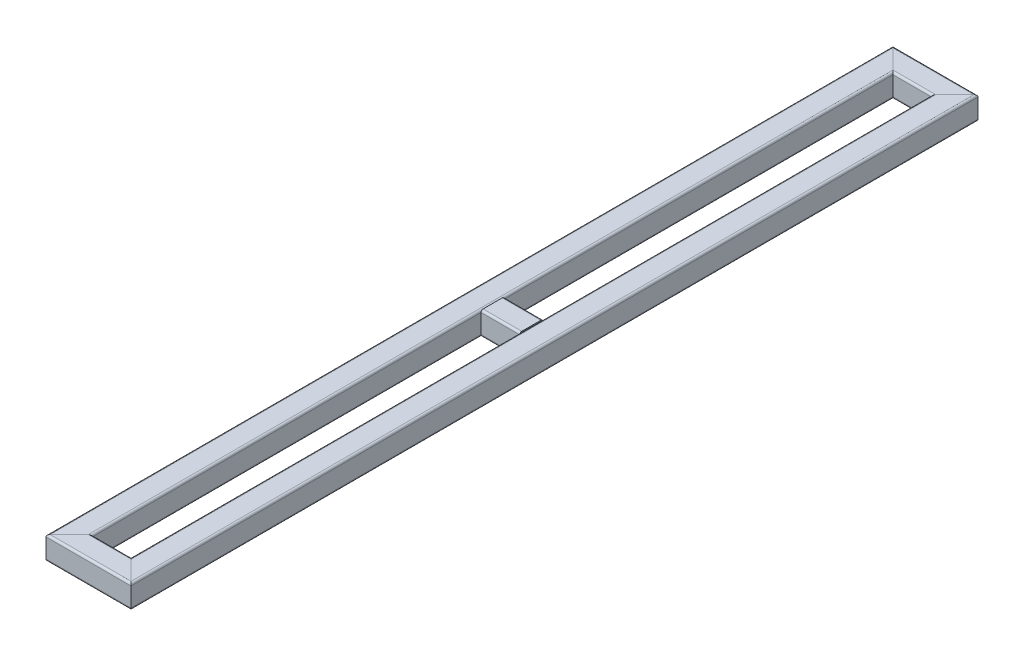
ISO-10303-21;
HEADER;
FILE_DESCRIPTION(('STEP AP214'),'2;1');
FILE_NAME('part.step','',(''),(''),'','','');
FILE_SCHEMA(('AUTOMOTIVE_DESIGN { 1 0 10303 214 1 1 1 1 }'));
ENDSEC;
DATA;
#1=APPLICATION_CONTEXT('core data for automotive mechanical design processes');
#2=APPLICATION_PROTOCOL_DEFINITION('international standard','automotive_design',2000,#1);
#3=PRODUCT_CONTEXT('',#1,'mechanical');
#4=PRODUCT('Part','Part','',(#3));
#5=PRODUCT_RELATED_PRODUCT_CATEGORY('part','',(#4));
#6=PRODUCT_DEFINITION_FORMATION('','',#4);
#7=PRODUCT_DEFINITION_CONTEXT('part definition',#1,'design');
#8=PRODUCT_DEFINITION('design','',#6,#7);
#9=PRODUCT_DEFINITION_SHAPE('','',#8);
#10=(LENGTH_UNIT() NAMED_UNIT(*) SI_UNIT(.MILLI.,.METRE.));
#11=(NAMED_UNIT(*) PLANE_ANGLE_UNIT() SI_UNIT($,.RADIAN.));
#12=(NAMED_UNIT(*) SI_UNIT($,.STERADIAN.) SOLID_ANGLE_UNIT());
#13=UNCERTAINTY_MEASURE_WITH_UNIT(LENGTH_MEASURE(1.E-05),#10,'distance_accuracy_value','');
#14=(GEOMETRIC_REPRESENTATION_CONTEXT(3) GLOBAL_UNCERTAINTY_ASSIGNED_CONTEXT((#13)) GLOBAL_UNIT_ASSIGNED_CONTEXT((#10,
#11,#12)) REPRESENTATION_CONTEXT('',''));
#15=CARTESIAN_POINT('',(0.,0.,0.));
#16=DIRECTION('',(0.,0.,1.));
#17=DIRECTION('',(1.,0.,0.));
#18=AXIS2_PLACEMENT_3D('',#15,#16,#17);
#19=CARTESIAN_POINT('',(18.5,18.5,0.));
#20=DIRECTION('',(0.,0.,-1.));
#21=DIRECTION('',(0.,1.,0.));
#22=AXIS2_PLACEMENT_3D('',#19,#20,#21);
#23=CYLINDRICAL_SURFACE('',#22,4.);
#24=CARTESIAN_POINT('',(18.5,18.5000000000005,-1579.5));
#25=DIRECTION('',(0.707106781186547,0.,-0.707106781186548));
#26=DIRECTION('',(-0.707106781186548,0.,-0.707106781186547));
#27=AXIS2_PLACEMENT_3D('',#24,#25,#26);
#28=ELLIPSE('',#27,5.65685424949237,4.);
#29=CARTESIAN_POINT('',(18.4999999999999,22.5000000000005,-1579.5));
#30=VERTEX_POINT('',#29);
#31=CARTESIAN_POINT('',(22.5,18.5000000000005,-1575.5));
#32=VERTEX_POINT('',#31);
#33=EDGE_CURVE('E215',#30,#32,#28,.T.);
#34=ORIENTED_EDGE('',*,*,#33,.F.);
#35=DIRECTION('',(0.,0.,-1.));
#36=VECTOR('',#35,1.);
#37=CARTESIAN_POINT('',(18.5,22.5,0.));
#38=LINE('',#37,#36);
#39=CARTESIAN_POINT('',(18.5,22.5,-18.5));
#40=VERTEX_POINT('',#39);
#41=EDGE_CURVE('E295',#40,#30,#38,.T.);
#42=ORIENTED_EDGE('',*,*,#41,.F.);
#43=CARTESIAN_POINT('',(18.5,18.5,-18.5));
#44=DIRECTION('',(0.707106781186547,0.,0.707106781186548));
#45=DIRECTION('',(0.707106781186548,0.,-0.707106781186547));
#46=AXIS2_PLACEMENT_3D('',#43,#44,#45);
#47=ELLIPSE('',#46,5.65685424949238,4.);
#48=CARTESIAN_POINT('',(22.5,18.5000000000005,-22.5));
#49=VERTEX_POINT('',#48);
#50=EDGE_CURVE('E206',#49,#40,#47,.T.);
#51=ORIENTED_EDGE('',*,*,#50,.F.);
#52=DIRECTION('',(0.,0.,-1.));
#53=VECTOR('',#52,1.);
#54=CARTESIAN_POINT('',(22.5,18.5,0.));
#55=LINE('',#54,#53);
#56=EDGE_CURVE('E75',#49,#32,#55,.T.);
#57=ORIENTED_EDGE('',*,*,#56,.T.);
#58=EDGE_LOOP('',(#34,#42,#51,#57));
#59=FACE_BOUND('',#58,.T.);
#60=ADVANCED_FACE('F71',(#59),#23,.T.);
#61=CARTESIAN_POINT('',(18.5,22.5,0.));
#62=DIRECTION('',(0.,-1.,0.));
#63=DIRECTION('',(0.,0.,-1.));
#64=AXIS2_PLACEMENT_3D('',#61,#62,#63);
#65=PLANE('',#64);
#66=DIRECTION('',(0.707106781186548,0.,0.707106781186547));
#67=VECTOR('',#66,1.);
#68=CARTESIAN_POINT('',(808.25,22.5000000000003,-789.750000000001));
#69=LINE('',#68,#67);
#70=CARTESIAN_POINT('',(-18.5,22.5000000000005,-1616.5));
#71=VERTEX_POINT('',#70);
#72=EDGE_CURVE('E212',#71,#30,#69,.T.);
#73=ORIENTED_EDGE('',*,*,#72,.F.);
#74=DIRECTION('',(0.,0.,-1.));
#75=VECTOR('',#74,1.);
#76=CARTESIAN_POINT('',(-18.5,22.5,0.));
#77=LINE('',#76,#75);
#78=CARTESIAN_POINT('',(-18.5,22.5,18.5));
#79=VERTEX_POINT('',#78);
#80=EDGE_CURVE('E293',#79,#71,#77,.T.);
#81=ORIENTED_EDGE('',*,*,#80,.F.);
#82=DIRECTION('',(-0.707106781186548,0.,0.707106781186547));
#83=VECTOR('',#82,1.);
#84=CARTESIAN_POINT('',(9.25000000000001,22.5,-9.25000000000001));
#85=LINE('',#84,#83);
#86=EDGE_CURVE('E311',#40,#79,#85,.T.);
#87=ORIENTED_EDGE('',*,*,#86,.F.);
#88=ORIENTED_EDGE('',*,*,#41,.T.);
#89=EDGE_LOOP('',(#73,#81,#87,#88));
#90=FACE_BOUND('',#89,.T.);
#91=ADVANCED_FACE('F302',(#90),#65,.F.);
#92=CARTESIAN_POINT('',(-18.5,18.5,0.));
#93=DIRECTION('',(0.,0.,-1.));
#94=DIRECTION('',(0.,1.,0.));
#95=AXIS2_PLACEMENT_3D('',#92,#93,#94);
#96=CYLINDRICAL_SURFACE('',#95,4.);
#97=CARTESIAN_POINT('',(-18.5,18.5000000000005,-1616.5));
#98=DIRECTION('',(0.707106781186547,0.,-0.707106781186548));
#99=DIRECTION('',(-0.707106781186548,0.,-0.707106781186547));
#100=AXIS2_PLACEMENT_3D('',#97,#98,#99);
#101=ELLIPSE('',#100,5.65685424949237,4.);
#102=CARTESIAN_POINT('',(-22.5,18.5000000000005,-1620.5));
#103=VERTEX_POINT('',#102);
#104=EDGE_CURVE('E13',#103,#71,#101,.T.);
#105=ORIENTED_EDGE('',*,*,#104,.F.);
#106=DIRECTION('',(0.,0.,-1.));
#107=VECTOR('',#106,1.);
#108=CARTESIAN_POINT('',(-22.5,18.5,0.));
#109=LINE('',#108,#107);
#110=CARTESIAN_POINT('',(-22.5,18.5,22.5));
#111=VERTEX_POINT('',#110);
#112=EDGE_CURVE('E290',#111,#103,#109,.T.);
#113=ORIENTED_EDGE('',*,*,#112,.F.);
#114=CARTESIAN_POINT('',(-18.5,18.5,18.5));
#115=DIRECTION('',(0.707106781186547,0.,0.707106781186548));
#116=DIRECTION('',(0.707106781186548,0.,-0.707106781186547));
#117=AXIS2_PLACEMENT_3D('',#114,#115,#116);
#118=ELLIPSE('',#117,5.65685424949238,4.);
#119=EDGE_CURVE('E308',#79,#111,#118,.T.);
#120=ORIENTED_EDGE('',*,*,#119,.F.);
#121=ORIENTED_EDGE('',*,*,#80,.T.);
#122=EDGE_LOOP('',(#105,#113,#120,#121));
#123=FACE_BOUND('',#122,.T.);
#124=ADVANCED_FACE('F305',(#123),#96,.T.);
#125=CARTESIAN_POINT('',(-22.5,-18.5,0.));
#126=DIRECTION('',(1.,0.,0.));
#127=DIRECTION('',(0.,0.,-1.));
#128=AXIS2_PLACEMENT_3D('',#125,#126,#127);
#129=PLANE('',#128);
#130=DIRECTION('',(0.,1.,0.));
#131=VECTOR('',#130,1.);
#132=CARTESIAN_POINT('',(-22.5,-18.4999999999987,-1620.5));
#133=LINE('',#132,#131);
#134=CARTESIAN_POINT('',(-22.5,-18.4999999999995,-1620.5));
#135=VERTEX_POINT('',#134);
#136=EDGE_CURVE('E81',#135,#103,#133,.T.);
#137=ORIENTED_EDGE('',*,*,#136,.F.);
#138=DIRECTION('',(0.,0.,-1.));
#139=VECTOR('',#138,1.);
#140=CARTESIAN_POINT('',(-22.5,-18.5,0.));
#141=LINE('',#140,#139);
#142=CARTESIAN_POINT('',(-22.5,-18.5,22.5));
#143=VERTEX_POINT('',#142);
#144=EDGE_CURVE('E287',#143,#135,#141,.T.);
#145=ORIENTED_EDGE('',*,*,#144,.F.);
#146=DIRECTION('',(0.,-1.,0.));
#147=VECTOR('',#146,1.);
#148=CARTESIAN_POINT('',(-22.5,-18.5,22.5));
#149=LINE('',#148,#147);
#150=EDGE_CURVE('E310',#111,#143,#149,.T.);
#151=ORIENTED_EDGE('',*,*,#150,.F.);
#152=ORIENTED_EDGE('',*,*,#112,.T.);
#153=EDGE_LOOP('',(#137,#145,#151,#152));
#154=FACE_BOUND('',#153,.T.);
#155=ADVANCED_FACE('F321',(#154),#129,.F.);
#156=CARTESIAN_POINT('',(-18.5,-18.5,0.));
#157=DIRECTION('',(0.,0.,-1.));
#158=DIRECTION('',(0.,1.,0.));
#159=AXIS2_PLACEMENT_3D('',#156,#157,#158);
#160=CYLINDRICAL_SURFACE('',#159,4.);
#161=CARTESIAN_POINT('',(-18.5,-18.4999999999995,-1616.5));
#162=DIRECTION('',(0.707106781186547,0.,-0.707106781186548));
#163=DIRECTION('',(-0.707106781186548,0.,-0.707106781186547));
#164=AXIS2_PLACEMENT_3D('',#161,#162,#163);
#165=ELLIPSE('',#164,5.65685424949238,4.);
#166=CARTESIAN_POINT('',(-18.5,-22.4999999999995,-1616.5));
#167=VERTEX_POINT('',#166);
#168=EDGE_CURVE('E230',#167,#135,#165,.T.);
#169=ORIENTED_EDGE('',*,*,#168,.F.);
#170=DIRECTION('',(0.,0.,-1.));
#171=VECTOR('',#170,1.);
#172=CARTESIAN_POINT('',(-18.5,-22.5,0.));
#173=LINE('',#172,#171);
#174=CARTESIAN_POINT('',(-18.5,-22.5,18.5));
#175=VERTEX_POINT('',#174);
#176=EDGE_CURVE('E284',#175,#167,#173,.T.);
#177=ORIENTED_EDGE('',*,*,#176,.F.);
#178=CARTESIAN_POINT('',(-18.5,-18.5,18.5));
#179=DIRECTION('',(0.707106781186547,0.,0.707106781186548));
#180=DIRECTION('',(0.707106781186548,0.,-0.707106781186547));
#181=AXIS2_PLACEMENT_3D('',#178,#179,#180);
#182=ELLIPSE('',#181,5.65685424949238,4.);
#183=EDGE_CURVE('E217',#143,#175,#182,.T.);
#184=ORIENTED_EDGE('',*,*,#183,.F.);
#185=ORIENTED_EDGE('',*,*,#144,.T.);
#186=EDGE_LOOP('',(#169,#177,#184,#185));
#187=FACE_BOUND('',#186,.T.);
#188=ADVANCED_FACE('F319',(#187),#160,.T.);
#189=CARTESIAN_POINT('',(-18.5,-22.5,0.));
#190=DIRECTION('',(0.,1.,0.));
#191=DIRECTION('',(0.,0.,1.));
#192=AXIS2_PLACEMENT_3D('',#189,#190,#191);
#193=PLANE('',#192);
#194=DIRECTION('',(-0.707106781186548,0.,-0.707106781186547));
#195=VECTOR('',#194,1.);
#196=CARTESIAN_POINT('',(789.75,-22.4999999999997,-808.250000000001));
#197=LINE('',#196,#195);
#198=CARTESIAN_POINT('',(18.5,-22.4999999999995,-1579.5));
#199=VERTEX_POINT('',#198);
#200=EDGE_CURVE('E233',#199,#167,#197,.T.);
#201=ORIENTED_EDGE('',*,*,#200,.F.);
#202=DIRECTION('',(0.,0.,-1.));
#203=VECTOR('',#202,1.);
#204=CARTESIAN_POINT('',(18.5,-22.5,0.));
#205=LINE('',#204,#203);
#206=CARTESIAN_POINT('',(18.5,-22.5,-18.5));
#207=VERTEX_POINT('',#206);
#208=EDGE_CURVE('E282',#207,#199,#205,.T.);
#209=ORIENTED_EDGE('',*,*,#208,.F.);
#210=DIRECTION('',(0.707106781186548,0.,-0.707106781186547));
#211=VECTOR('',#210,1.);
#212=CARTESIAN_POINT('',(-9.25000000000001,-22.5,9.25000000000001));
#213=LINE('',#212,#211);
#214=EDGE_CURVE('E211',#175,#207,#213,.T.);
#215=ORIENTED_EDGE('',*,*,#214,.F.);
#216=ORIENTED_EDGE('',*,*,#176,.T.);
#217=EDGE_LOOP('',(#201,#209,#215,#216));
#218=FACE_BOUND('',#217,.T.);
#219=ADVANCED_FACE('F323',(#218),#193,.F.);
#220=CARTESIAN_POINT('',(18.5,-18.5,0.));
#221=DIRECTION('',(0.,0.,-1.));
#222=DIRECTION('',(0.,1.,0.));
#223=AXIS2_PLACEMENT_3D('',#220,#221,#222);
#224=CYLINDRICAL_SURFACE('',#223,4.);
#225=CARTESIAN_POINT('',(18.5,-18.4999999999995,-1579.5));
#226=DIRECTION('',(0.707106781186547,0.,-0.707106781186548));
#227=DIRECTION('',(-0.707106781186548,0.,-0.707106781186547));
#228=AXIS2_PLACEMENT_3D('',#225,#226,#227);
#229=ELLIPSE('',#228,5.65685424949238,4.);
#230=CARTESIAN_POINT('',(22.5,-18.5000000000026,-1575.5));
#231=VERTEX_POINT('',#230);
#232=EDGE_CURVE('E194',#231,#199,#229,.T.);
#233=ORIENTED_EDGE('',*,*,#232,.F.);
#234=DIRECTION('',(0.,0.,-1.));
#235=VECTOR('',#234,1.);
#236=CARTESIAN_POINT('',(22.5,-18.5,0.));
#237=LINE('',#236,#235);
#238=CARTESIAN_POINT('',(22.5,-18.5,-22.5));
#239=VERTEX_POINT('',#238);
#240=EDGE_CURVE('E186',#239,#231,#237,.T.);
#241=ORIENTED_EDGE('',*,*,#240,.F.);
#242=CARTESIAN_POINT('',(18.5,-18.5,-18.5));
#243=DIRECTION('',(0.707106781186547,0.,0.707106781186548));
#244=DIRECTION('',(0.707106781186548,0.,-0.707106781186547));
#245=AXIS2_PLACEMENT_3D('',#242,#243,#244);
#246=ELLIPSE('',#245,5.65685424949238,4.);
#247=EDGE_CURVE('E191',#207,#239,#246,.T.);
#248=ORIENTED_EDGE('',*,*,#247,.F.);
#249=ORIENTED_EDGE('',*,*,#208,.T.);
#250=EDGE_LOOP('',(#233,#241,#248,#249));
#251=FACE_BOUND('',#250,.T.);
#252=ADVANCED_FACE('F188',(#251),#224,.T.);
#253=CARTESIAN_POINT('',(-18.5,18.5,0.));
#254=DIRECTION('',(0.,0.,-1.));
#255=DIRECTION('',(0.,1.,0.));
#256=AXIS2_PLACEMENT_3D('',#253,#254,#255);
#257=CYLINDRICAL_SURFACE('',#256,1.99999999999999);
#258=DIRECTION('',(0.,0.,-1.));
#259=VECTOR('',#258,1.);
#260=CARTESIAN_POINT('',(-20.5,18.5,0.));
#261=LINE('',#260,#259);
#262=CARTESIAN_POINT('',(-20.5,18.5000000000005,20.5));
#263=VERTEX_POINT('',#262);
#264=CARTESIAN_POINT('',(-20.5,18.5000000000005,-1618.5));
#265=VERTEX_POINT('',#264);
#266=EDGE_CURVE('E239',#263,#265,#261,.T.);
#267=ORIENTED_EDGE('',*,*,#266,.T.);
#268=CARTESIAN_POINT('',(-18.5,18.5000000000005,-1616.5));
#269=DIRECTION('',(0.707106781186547,0.,-0.707106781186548));
#270=DIRECTION('',(-0.707106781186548,0.,-0.707106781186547));
#271=AXIS2_PLACEMENT_3D('',#268,#269,#270);
#272=ELLIPSE('',#271,2.82842712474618,1.99999999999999);
#273=CARTESIAN_POINT('',(-18.5,20.5000000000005,-1616.5));
#274=VERTEX_POINT('',#273);
#275=EDGE_CURVE('E117',#265,#274,#272,.T.);
#276=ORIENTED_EDGE('',*,*,#275,.T.);
#277=DIRECTION('',(0.,0.,-1.));
#278=VECTOR('',#277,1.);
#279=CARTESIAN_POINT('',(-18.5,20.5,0.));
#280=LINE('',#279,#278);
#281=CARTESIAN_POINT('',(-18.5,20.5,18.5));
#282=VERTEX_POINT('',#281);
#283=EDGE_CURVE('E242',#282,#274,#280,.T.);
#284=ORIENTED_EDGE('',*,*,#283,.F.);
#285=CARTESIAN_POINT('',(-18.5,18.5,18.5));
#286=DIRECTION('',(0.707106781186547,0.,0.707106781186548));
#287=DIRECTION('',(0.707106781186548,0.,-0.707106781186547));
#288=AXIS2_PLACEMENT_3D('',#285,#286,#287);
#289=ELLIPSE('',#288,2.82842712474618,1.99999999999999);
#290=EDGE_CURVE('E238',#282,#263,#289,.T.);
#291=ORIENTED_EDGE('',*,*,#290,.T.);
#292=EDGE_LOOP('',(#267,#276,#284,#291));
#293=FACE_BOUND('',#292,.T.);
#294=ADVANCED_FACE('F330',(#293),#257,.F.);
#295=CARTESIAN_POINT('',(18.5,20.5,0.));
#296=DIRECTION('',(0.,-1.,0.));
#297=DIRECTION('',(0.,0.,-1.));
#298=AXIS2_PLACEMENT_3D('',#295,#296,#297);
#299=PLANE('',#298);
#300=ORIENTED_EDGE('',*,*,#283,.T.);
#301=DIRECTION('',(0.707106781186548,0.,0.707106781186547));
#302=VECTOR('',#301,1.);
#303=CARTESIAN_POINT('',(808.25,20.5000000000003,-789.750000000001));
#304=LINE('',#303,#302);
#305=CARTESIAN_POINT('',(18.5,20.5000000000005,-1579.5));
#306=VERTEX_POINT('',#305);
#307=EDGE_CURVE('E90',#274,#306,#304,.T.);
#308=ORIENTED_EDGE('',*,*,#307,.T.);
#309=DIRECTION('',(0.,0.,-1.));
#310=VECTOR('',#309,1.);
#311=CARTESIAN_POINT('',(18.5,20.5,0.));
#312=LINE('',#311,#310);
#313=CARTESIAN_POINT('',(18.5,20.5,-18.5));
#314=VERTEX_POINT('',#313);
#315=EDGE_CURVE('E247',#314,#306,#312,.T.);
#316=ORIENTED_EDGE('',*,*,#315,.F.);
#317=DIRECTION('',(-0.707106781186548,0.,0.707106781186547));
#318=VECTOR('',#317,1.);
#319=CARTESIAN_POINT('',(9.25,20.5,-9.25));
#320=LINE('',#319,#318);
#321=EDGE_CURVE('E241',#314,#282,#320,.T.);
#322=ORIENTED_EDGE('',*,*,#321,.T.);
#323=EDGE_LOOP('',(#300,#308,#316,#322));
#324=FACE_BOUND('',#323,.T.);
#325=ADVANCED_FACE('F372',(#324),#299,.T.);
#326=CARTESIAN_POINT('',(18.5,18.5,0.));
#327=DIRECTION('',(0.,0.,-1.));
#328=DIRECTION('',(0.,1.,0.));
#329=AXIS2_PLACEMENT_3D('',#326,#327,#328);
#330=CYLINDRICAL_SURFACE('',#329,1.99999999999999);
#331=ORIENTED_EDGE('',*,*,#315,.T.);
#332=CARTESIAN_POINT('',(18.5,18.5000000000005,-1579.5));
#333=DIRECTION('',(0.707106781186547,0.,-0.707106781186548));
#334=DIRECTION('',(-0.707106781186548,0.,-0.707106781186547));
#335=AXIS2_PLACEMENT_3D('',#332,#333,#334);
#336=ELLIPSE('',#335,2.82842712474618,1.99999999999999);
#337=CARTESIAN_POINT('',(20.5,18.5000000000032,-1577.5));
#338=VERTEX_POINT('',#337);
#339=EDGE_CURVE('E243',#306,#338,#336,.T.);
#340=ORIENTED_EDGE('',*,*,#339,.T.);
#341=DIRECTION('',(0.,0.,-1.));
#342=VECTOR('',#341,1.);
#343=CARTESIAN_POINT('',(20.5,18.5,0.));
#344=LINE('',#343,#342);
#345=CARTESIAN_POINT('',(20.5,18.5000000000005,-20.5));
#346=VERTEX_POINT('',#345);
#347=EDGE_CURVE('E252',#346,#338,#344,.T.);
#348=ORIENTED_EDGE('',*,*,#347,.F.);
#349=CARTESIAN_POINT('',(18.5,18.5,-18.5));
#350=DIRECTION('',(0.707106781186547,0.,0.707106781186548));
#351=DIRECTION('',(0.707106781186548,0.,-0.707106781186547));
#352=AXIS2_PLACEMENT_3D('',#349,#350,#351);
#353=ELLIPSE('',#352,2.82842712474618,1.99999999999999);
#354=EDGE_CURVE('E246',#346,#314,#353,.T.);
#355=ORIENTED_EDGE('',*,*,#354,.T.);
#356=EDGE_LOOP('',(#331,#340,#348,#355));
#357=FACE_BOUND('',#356,.T.);
#358=ADVANCED_FACE('F383',(#357),#330,.F.);
#359=CARTESIAN_POINT('',(20.5,18.5,0.));
#360=DIRECTION('',(-1.,0.,0.));
#361=DIRECTION('',(0.,0.,1.));
#362=AXIS2_PLACEMENT_3D('',#359,#360,#361);
#363=PLANE('',#362);
#364=ORIENTED_EDGE('',*,*,#347,.T.);
#365=DIRECTION('',(0.,-1.,0.));
#366=VECTOR('',#365,1.);
#367=CARTESIAN_POINT('',(20.5,18.5000000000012,-1577.5));
#368=LINE('',#367,#366);
#369=CARTESIAN_POINT('',(20.5,-18.4999999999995,-1577.5));
#370=VERTEX_POINT('',#369);
#371=EDGE_CURVE('E248',#338,#370,#368,.T.);
#372=ORIENTED_EDGE('',*,*,#371,.T.);
#373=DIRECTION('',(0.,0.,-1.));
#374=VECTOR('',#373,1.);
#375=CARTESIAN_POINT('',(20.5,-18.5,0.));
#376=LINE('',#375,#374);
#377=CARTESIAN_POINT('',(20.5,-18.5,-20.5));
#378=VERTEX_POINT('',#377);
#379=EDGE_CURVE('E257',#378,#370,#376,.T.);
#380=ORIENTED_EDGE('',*,*,#379,.F.);
#381=DIRECTION('',(0.,1.,0.));
#382=VECTOR('',#381,1.);
#383=CARTESIAN_POINT('',(20.5,18.5,-20.5));
#384=LINE('',#383,#382);
#385=EDGE_CURVE('E251',#378,#346,#384,.T.);
#386=ORIENTED_EDGE('',*,*,#385,.T.);
#387=EDGE_LOOP('',(#364,#372,#380,#386));
#388=FACE_BOUND('',#387,.T.);
#389=ADVANCED_FACE('F394',(#388),#363,.T.);
#390=CARTESIAN_POINT('',(18.5,-18.5,0.));
#391=DIRECTION('',(0.,0.,-1.));
#392=DIRECTION('',(0.,1.,0.));
#393=AXIS2_PLACEMENT_3D('',#390,#391,#392);
#394=CYLINDRICAL_SURFACE('',#393,2.);
#395=ORIENTED_EDGE('',*,*,#379,.T.);
#396=CARTESIAN_POINT('',(18.5,-18.4999999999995,-1579.5));
#397=DIRECTION('',(0.707106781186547,0.,-0.707106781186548));
#398=DIRECTION('',(-0.707106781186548,0.,-0.707106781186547));
#399=AXIS2_PLACEMENT_3D('',#396,#397,#398);
#400=ELLIPSE('',#399,2.82842712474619,2.);
#401=CARTESIAN_POINT('',(18.5,-20.4999999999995,-1579.5));
#402=VERTEX_POINT('',#401);
#403=EDGE_CURVE('E253',#370,#402,#400,.T.);
#404=ORIENTED_EDGE('',*,*,#403,.T.);
#405=DIRECTION('',(0.,0.,-1.));
#406=VECTOR('',#405,1.);
#407=CARTESIAN_POINT('',(18.5,-20.5,0.));
#408=LINE('',#407,#406);
#409=CARTESIAN_POINT('',(18.5,-20.5,-18.5));
#410=VERTEX_POINT('',#409);
#411=EDGE_CURVE('E262',#410,#402,#408,.T.);
#412=ORIENTED_EDGE('',*,*,#411,.F.);
#413=CARTESIAN_POINT('',(18.5,-18.5,-18.5));
#414=DIRECTION('',(0.707106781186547,0.,0.707106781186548));
#415=DIRECTION('',(0.707106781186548,0.,-0.707106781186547));
#416=AXIS2_PLACEMENT_3D('',#413,#414,#415);
#417=ELLIPSE('',#416,2.82842712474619,2.);
#418=EDGE_CURVE('E256',#410,#378,#417,.T.);
#419=ORIENTED_EDGE('',*,*,#418,.T.);
#420=EDGE_LOOP('',(#395,#404,#412,#419));
#421=FACE_BOUND('',#420,.T.);
#422=ADVANCED_FACE('F405',(#421),#394,.F.);
#423=CARTESIAN_POINT('',(-18.5,-20.5,0.));
#424=DIRECTION('',(0.,1.,0.));
#425=DIRECTION('',(0.,0.,1.));
#426=AXIS2_PLACEMENT_3D('',#423,#424,#425);
#427=PLANE('',#426);
#428=ORIENTED_EDGE('',*,*,#411,.T.);
#429=DIRECTION('',(-0.707106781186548,0.,-0.707106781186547));
#430=VECTOR('',#429,1.);
#431=CARTESIAN_POINT('',(789.75,-20.4999999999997,-808.250000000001));
#432=LINE('',#431,#430);
#433=CARTESIAN_POINT('',(-18.5,-20.4999999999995,-1616.5));
#434=VERTEX_POINT('',#433);
#435=EDGE_CURVE('E258',#402,#434,#432,.T.);
#436=ORIENTED_EDGE('',*,*,#435,.T.);
#437=DIRECTION('',(0.,0.,-1.));
#438=VECTOR('',#437,1.);
#439=CARTESIAN_POINT('',(-18.5,-20.5,0.));
#440=LINE('',#439,#438);
#441=CARTESIAN_POINT('',(-18.5,-20.5,18.5));
#442=VERTEX_POINT('',#441);
#443=EDGE_CURVE('E266',#442,#434,#440,.T.);
#444=ORIENTED_EDGE('',*,*,#443,.F.);
#445=DIRECTION('',(0.707106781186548,0.,-0.707106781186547));
#446=VECTOR('',#445,1.);
#447=CARTESIAN_POINT('',(-9.25,-20.5,9.25));
#448=LINE('',#447,#446);
#449=EDGE_CURVE('E261',#442,#410,#448,.T.);
#450=ORIENTED_EDGE('',*,*,#449,.T.);
#451=EDGE_LOOP('',(#428,#436,#444,#450));
#452=FACE_BOUND('',#451,.T.);
#453=ADVANCED_FACE('F416',(#452),#427,.T.);
#454=CARTESIAN_POINT('',(-18.5,-18.5,0.));
#455=DIRECTION('',(0.,0.,-1.));
#456=DIRECTION('',(0.,1.,0.));
#457=AXIS2_PLACEMENT_3D('',#454,#455,#456);
#458=CYLINDRICAL_SURFACE('',#457,2.);
#459=ORIENTED_EDGE('',*,*,#443,.T.);
#460=CARTESIAN_POINT('',(-18.5,-18.4999999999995,-1616.5));
#461=DIRECTION('',(0.707106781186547,0.,-0.707106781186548));
#462=DIRECTION('',(-0.707106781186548,0.,-0.707106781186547));
#463=AXIS2_PLACEMENT_3D('',#460,#461,#462);
#464=ELLIPSE('',#463,2.82842712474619,2.);
#465=CARTESIAN_POINT('',(-20.5,-18.5000000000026,-1618.5));
#466=VERTEX_POINT('',#465);
#467=EDGE_CURVE('E263',#434,#466,#464,.T.);
#468=ORIENTED_EDGE('',*,*,#467,.T.);
#469=DIRECTION('',(0.,0.,-1.));
#470=VECTOR('',#469,1.);
#471=CARTESIAN_POINT('',(-20.5,-18.5,0.));
#472=LINE('',#471,#470);
#473=CARTESIAN_POINT('',(-20.5,-18.5,20.5));
#474=VERTEX_POINT('',#473);
#475=EDGE_CURVE('E224',#474,#466,#472,.T.);
#476=ORIENTED_EDGE('',*,*,#475,.F.);
#477=CARTESIAN_POINT('',(-18.5,-18.5,18.5));
#478=DIRECTION('',(0.707106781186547,0.,0.707106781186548));
#479=DIRECTION('',(0.707106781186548,0.,-0.707106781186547));
#480=AXIS2_PLACEMENT_3D('',#477,#478,#479);
#481=ELLIPSE('',#480,2.82842712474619,2.);
#482=EDGE_CURVE('E265',#474,#442,#481,.T.);
#483=ORIENTED_EDGE('',*,*,#482,.T.);
#484=EDGE_LOOP('',(#459,#468,#476,#483));
#485=FACE_BOUND('',#484,.T.);
#486=ADVANCED_FACE('F427',(#485),#458,.F.);
#487=CARTESIAN_POINT('',(-20.5,-18.5,0.));
#488=DIRECTION('',(1.,0.,0.));
#489=DIRECTION('',(0.,0.,-1.));
#490=AXIS2_PLACEMENT_3D('',#487,#488,#489);
#491=PLANE('',#490);
#492=ORIENTED_EDGE('',*,*,#475,.T.);
#493=DIRECTION('',(0.,1.,0.));
#494=VECTOR('',#493,1.);
#495=CARTESIAN_POINT('',(-20.5,-18.4999999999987,-1618.5));
#496=LINE('',#495,#494);
#497=EDGE_CURVE('E112',#466,#265,#496,.T.);
#498=ORIENTED_EDGE('',*,*,#497,.T.);
#499=ORIENTED_EDGE('',*,*,#266,.F.);
#500=DIRECTION('',(0.,-1.,0.));
#501=VECTOR('',#500,1.);
#502=CARTESIAN_POINT('',(-20.5,-18.5,20.5));
#503=LINE('',#502,#501);
#504=EDGE_CURVE('E199',#263,#474,#503,.T.);
#505=ORIENTED_EDGE('',*,*,#504,.T.);
#506=EDGE_LOOP('',(#492,#498,#499,#505));
#507=FACE_BOUND('',#506,.T.);
#508=ADVANCED_FACE('F438',(#507),#491,.T.);
#509=CARTESIAN_POINT('',(22.5,18.5,0.));
#510=DIRECTION('',(-1.,0.,0.));
#511=DIRECTION('',(0.,0.,1.));
#512=AXIS2_PLACEMENT_3D('',#509,#510,#511);
#513=PLANE('',#512);
#514=DIRECTION('',(0.,-1.,0.));
#515=VECTOR('',#514,1.);
#516=CARTESIAN_POINT('',(22.5,18.5000000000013,-1575.5));
#517=LINE('',#516,#515);
#518=EDGE_CURVE('E226',#32,#231,#517,.T.);
#519=ORIENTED_EDGE('',*,*,#518,.F.);
#520=ORIENTED_EDGE('',*,*,#56,.F.);
#521=DIRECTION('',(0.,1.,0.));
#522=VECTOR('',#521,1.);
#523=CARTESIAN_POINT('',(22.5,18.5,-22.5));
#524=LINE('',#523,#522);
#525=EDGE_CURVE('E198',#239,#49,#524,.T.);
#526=ORIENTED_EDGE('',*,*,#525,.F.);
#527=ORIENTED_EDGE('',*,*,#240,.T.);
#528=EDGE_LOOP('',(#519,#520,#526,#527));
#529=FACE_BOUND('',#528,.T.);
#530=ADVANCED_FACE('F202',(#529),#513,.F.);
#531=CARTESIAN_POINT('',(0.,0.,0.));
#532=DIRECTION('',(0.707106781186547,0.,0.707106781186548));
#533=DIRECTION('',(0.707106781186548,0.,-0.707106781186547));
#534=AXIS2_PLACEMENT_3D('',#531,#532,#533);
#535=PLANE('',#534);
#536=ORIENTED_EDGE('',*,*,#290,.F.);
#537=ORIENTED_EDGE('',*,*,#321,.F.);
#538=ORIENTED_EDGE('',*,*,#354,.F.);
#539=ORIENTED_EDGE('',*,*,#385,.F.);
#540=ORIENTED_EDGE('',*,*,#418,.F.);
#541=ORIENTED_EDGE('',*,*,#449,.F.);
#542=ORIENTED_EDGE('',*,*,#482,.F.);
#543=ORIENTED_EDGE('',*,*,#504,.F.);
#544=EDGE_LOOP('',(#536,#537,#538,#539,#540,#541,#542,#543));
#545=FACE_BOUND('',#544,.T.);
#546=ORIENTED_EDGE('',*,*,#525,.T.);
#547=ORIENTED_EDGE('',*,*,#50,.T.);
#548=ORIENTED_EDGE('',*,*,#86,.T.);
#549=ORIENTED_EDGE('',*,*,#119,.T.);
#550=ORIENTED_EDGE('',*,*,#150,.T.);
#551=ORIENTED_EDGE('',*,*,#183,.T.);
#552=ORIENTED_EDGE('',*,*,#214,.T.);
#553=ORIENTED_EDGE('',*,*,#247,.T.);
#554=EDGE_LOOP('',(#546,#547,#548,#549,#550,#551,#552,#553));
#555=FACE_BOUND('',#554,.T.);
#556=ADVANCED_FACE('F209',(#545,#555),#535,.T.);
#557=CARTESIAN_POINT('',(0.,5.253822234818E-13,-1598.));
#558=DIRECTION('',(0.707106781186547,0.,-0.707106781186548));
#559=DIRECTION('',(-0.707106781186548,0.,-0.707106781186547));
#560=AXIS2_PLACEMENT_3D('',#557,#558,#559);
#561=PLANE('',#560);
#562=ORIENTED_EDGE('',*,*,#275,.F.);
#563=ORIENTED_EDGE('',*,*,#497,.F.);
#564=ORIENTED_EDGE('',*,*,#467,.F.);
#565=ORIENTED_EDGE('',*,*,#435,.F.);
#566=ORIENTED_EDGE('',*,*,#403,.F.);
#567=ORIENTED_EDGE('',*,*,#371,.F.);
#568=ORIENTED_EDGE('',*,*,#339,.F.);
#569=ORIENTED_EDGE('',*,*,#307,.F.);
#570=EDGE_LOOP('',(#562,#563,#564,#565,#566,#567,#568,#569));
#571=FACE_BOUND('',#570,.T.);
#572=ORIENTED_EDGE('',*,*,#72,.T.);
#573=ORIENTED_EDGE('',*,*,#33,.T.);
#574=ORIENTED_EDGE('',*,*,#518,.T.);
#575=ORIENTED_EDGE('',*,*,#232,.T.);
#576=ORIENTED_EDGE('',*,*,#200,.T.);
#577=ORIENTED_EDGE('',*,*,#168,.T.);
#578=ORIENTED_EDGE('',*,*,#136,.T.);
#579=ORIENTED_EDGE('',*,*,#104,.T.);
#580=EDGE_LOOP('',(#572,#573,#574,#575,#576,#577,#578,#579));
#581=FACE_BOUND('',#580,.T.);
#582=ADVANCED_FACE('F73',(#571,#581),#561,.T.);
#583=CLOSED_SHELL('',(#60,#91,#124,#155,#188,#219,#252,#294,#325,#358,#389,#422,#453,#486,#508,
#530,#556,#582));
#584=MANIFOLD_SOLID_BREP('B2',#583);
#585=CARTESIAN_POINT('',(1.11022302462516E-13,18.5000000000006,-1579.5));
#586=DIRECTION('',(1.,0.,0.));
#587=DIRECTION('',(0.,0.,-1.));
#588=AXIS2_PLACEMENT_3D('',#585,#586,#587);
#589=CYLINDRICAL_SURFACE('',#588,4.);
#590=CARTESIAN_POINT('',(18.5000000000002,18.5000000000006,-1579.5));
#591=DIRECTION('',(-0.707106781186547,0.,0.707106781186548));
#592=DIRECTION('',(0.707106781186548,0.,0.707106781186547));
#593=AXIS2_PLACEMENT_3D('',#590,#591,#592);
#594=ELLIPSE('',#593,5.65685424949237,4.);
#595=CARTESIAN_POINT('',(22.5000000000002,18.5000000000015,-1575.5));
#596=VERTEX_POINT('',#595);
#597=CARTESIAN_POINT('',(18.5000000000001,22.5000000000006,-1579.5));
#598=VERTEX_POINT('',#597);
#599=EDGE_CURVE('E697',#596,#598,#594,.T.);
#600=ORIENTED_EDGE('',*,*,#599,.F.);
#601=DIRECTION('',(1.,0.,0.));
#602=VECTOR('',#601,1.);
#603=CARTESIAN_POINT('',(1.11022302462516E-13,18.5000000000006,-1575.5));
#604=LINE('',#603,#602);
#605=CARTESIAN_POINT('',(97.4999999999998,18.5000000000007,-1575.5));
#606=VERTEX_POINT('',#605);
#607=EDGE_CURVE('E573',#596,#606,#604,.T.);
#608=ORIENTED_EDGE('',*,*,#607,.T.);
#609=CARTESIAN_POINT('',(101.5,18.5000000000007,-1579.5));
#610=DIRECTION('',(0.707106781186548,0.,0.707106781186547));
#611=DIRECTION('',(0.707106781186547,0.,-0.707106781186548));
#612=AXIS2_PLACEMENT_3D('',#609,#610,#611);
#613=ELLIPSE('',#612,5.65685424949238,4.);
#614=CARTESIAN_POINT('',(101.5,22.5000000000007,-1579.5));
#615=VERTEX_POINT('',#614);
#616=EDGE_CURVE('E778',#615,#606,#613,.T.);
#617=ORIENTED_EDGE('',*,*,#616,.F.);
#618=DIRECTION('',(1.,0.,0.));
#619=VECTOR('',#618,1.);
#620=CARTESIAN_POINT('',(1.11022302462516E-13,22.5000000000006,-1579.5));
#621=LINE('',#620,#619);
#622=EDGE_CURVE('E771',#598,#615,#621,.T.);
#623=ORIENTED_EDGE('',*,*,#622,.F.);
#624=EDGE_LOOP('',(#600,#608,#617,#623));
#625=FACE_BOUND('',#624,.T.);
#626=ADVANCED_FACE('F569',(#625),#589,.T.);
#627=CARTESIAN_POINT('',(1.11022302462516E-13,22.5000000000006,-1579.5));
#628=DIRECTION('',(0.,-1.,0.));
#629=DIRECTION('',(0.,0.,-1.));
#630=AXIS2_PLACEMENT_3D('',#627,#628,#629);
#631=PLANE('',#630);
#632=DIRECTION('',(-0.707106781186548,0.,-0.707106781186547));
#633=VECTOR('',#632,1.);
#634=CARTESIAN_POINT('',(9.25000000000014,22.5000000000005,-1588.75));
#635=LINE('',#634,#633);
#636=CARTESIAN_POINT('',(-18.4999999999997,22.5000000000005,-1616.5));
#637=VERTEX_POINT('',#636);
#638=EDGE_CURVE('E715',#598,#637,#635,.T.);
#639=ORIENTED_EDGE('',*,*,#638,.F.);
#640=ORIENTED_EDGE('',*,*,#622,.T.);
#641=DIRECTION('',(-0.707106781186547,0.,0.707106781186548));
#642=VECTOR('',#641,1.);
#643=CARTESIAN_POINT('',(50.75,22.5000000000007,-1528.75));
#644=LINE('',#643,#642);
#645=CARTESIAN_POINT('',(138.5,22.5000000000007,-1616.5));
#646=VERTEX_POINT('',#645);
#647=EDGE_CURVE('E687',#646,#615,#644,.T.);
#648=ORIENTED_EDGE('',*,*,#647,.F.);
#649=DIRECTION('',(1.,0.,0.));
#650=VECTOR('',#649,1.);
#651=CARTESIAN_POINT('',(1.11022302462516E-13,22.5000000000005,-1616.5));
#652=LINE('',#651,#650);
#653=EDGE_CURVE('E770',#637,#646,#652,.T.);
#654=ORIENTED_EDGE('',*,*,#653,.F.);
#655=EDGE_LOOP('',(#639,#640,#648,#654));
#656=FACE_BOUND('',#655,.T.);
#657=ADVANCED_FACE('F825',(#656),#631,.F.);
#658=CARTESIAN_POINT('',(1.11022302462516E-13,18.5000000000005,-1616.5));
#659=DIRECTION('',(1.,0.,0.));
#660=DIRECTION('',(0.,0.,-1.));
#661=AXIS2_PLACEMENT_3D('',#658,#659,#660);
#662=CYLINDRICAL_SURFACE('',#661,4.);
#663=CARTESIAN_POINT('',(-18.4999999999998,18.5000000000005,-1616.5));
#664=DIRECTION('',(-0.707106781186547,0.,0.707106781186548));
#665=DIRECTION('',(0.707106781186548,0.,0.707106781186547));
#666=AXIS2_PLACEMENT_3D('',#663,#664,#665);
#667=ELLIPSE('',#666,5.65685424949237,4.);
#668=CARTESIAN_POINT('',(-22.4999999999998,18.5000000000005,-1620.5));
#669=VERTEX_POINT('',#668);
#670=EDGE_CURVE('E712',#637,#669,#667,.T.);
#671=ORIENTED_EDGE('',*,*,#670,.F.);
#672=ORIENTED_EDGE('',*,*,#653,.T.);
#673=CARTESIAN_POINT('',(138.5,18.5000000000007,-1616.5));
#674=DIRECTION('',(0.707106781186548,0.,0.707106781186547));
#675=DIRECTION('',(0.707106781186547,0.,-0.707106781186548));
#676=AXIS2_PLACEMENT_3D('',#673,#674,#675);
#677=ELLIPSE('',#676,5.65685424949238,4.);
#678=CARTESIAN_POINT('',(142.5,18.5000000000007,-1620.5));
#679=VERTEX_POINT('',#678);
#680=EDGE_CURVE('E698',#679,#646,#677,.T.);
#681=ORIENTED_EDGE('',*,*,#680,.F.);
#682=DIRECTION('',(1.,0.,0.));
#683=VECTOR('',#682,1.);
#684=CARTESIAN_POINT('',(1.11022302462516E-13,18.5000000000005,-1620.5));
#685=LINE('',#684,#683);
#686=EDGE_CURVE('E768',#669,#679,#685,.T.);
#687=ORIENTED_EDGE('',*,*,#686,.F.);
#688=EDGE_LOOP('',(#671,#672,#681,#687));
#689=FACE_BOUND('',#688,.T.);
#690=ADVANCED_FACE('F823',(#689),#662,.T.);
#691=CARTESIAN_POINT('',(1.11022302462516E-13,-18.4999999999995,-1620.5));
#692=DIRECTION('',(0.,0.,1.));
#693=DIRECTION('',(1.,0.,0.));
#694=AXIS2_PLACEMENT_3D('',#691,#692,#693);
#695=PLANE('',#694);
#696=DIRECTION('',(0.,-1.,0.));
#697=VECTOR('',#696,1.);
#698=CARTESIAN_POINT('',(-22.4999999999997,-18.4999999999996,-1620.5));
#699=LINE('',#698,#697);
#700=CARTESIAN_POINT('',(-22.4999999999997,-18.4999999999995,-1620.5));
#701=VERTEX_POINT('',#700);
#702=EDGE_CURVE('E707',#669,#701,#699,.T.);
#703=ORIENTED_EDGE('',*,*,#702,.F.);
#704=ORIENTED_EDGE('',*,*,#686,.T.);
#705=DIRECTION('',(0.,1.,0.));
#706=VECTOR('',#705,1.);
#707=CARTESIAN_POINT('',(142.5,-18.4999999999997,-1620.5));
#708=LINE('',#707,#706);
#709=CARTESIAN_POINT('',(142.5,-18.4999999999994,-1620.5));
#710=VERTEX_POINT('',#709);
#711=EDGE_CURVE('E817',#710,#679,#708,.T.);
#712=ORIENTED_EDGE('',*,*,#711,.F.);
#713=DIRECTION('',(1.,0.,0.));
#714=VECTOR('',#713,1.);
#715=CARTESIAN_POINT('',(1.11022302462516E-13,-18.4999999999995,-1620.5));
#716=LINE('',#715,#714);
#717=EDGE_CURVE('E766',#701,#710,#716,.T.);
#718=ORIENTED_EDGE('',*,*,#717,.F.);
#719=EDGE_LOOP('',(#703,#704,#712,#718));
#720=FACE_BOUND('',#719,.T.);
#721=ADVANCED_FACE('F832',(#720),#695,.F.);
#722=CARTESIAN_POINT('',(1.11022302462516E-13,-18.4999999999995,-1616.5));
#723=DIRECTION('',(1.,0.,0.));
#724=DIRECTION('',(0.,0.,-1.));
#725=AXIS2_PLACEMENT_3D('',#722,#723,#724);
#726=CYLINDRICAL_SURFACE('',#725,4.);
#727=CARTESIAN_POINT('',(-18.4999999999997,-18.4999999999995,-1616.5));
#728=DIRECTION('',(-0.707106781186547,0.,0.707106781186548));
#729=DIRECTION('',(0.707106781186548,0.,0.707106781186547));
#730=AXIS2_PLACEMENT_3D('',#727,#728,#729);
#731=ELLIPSE('',#730,5.65685424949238,4.);
#732=CARTESIAN_POINT('',(-18.4999999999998,-22.4999999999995,-1616.5));
#733=VERTEX_POINT('',#732);
#734=EDGE_CURVE('E703',#701,#733,#731,.T.);
#735=ORIENTED_EDGE('',*,*,#734,.F.);
#736=ORIENTED_EDGE('',*,*,#717,.T.);
#737=CARTESIAN_POINT('',(138.5,-18.4999999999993,-1616.5));
#738=DIRECTION('',(0.707106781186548,0.,0.707106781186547));
#739=DIRECTION('',(0.707106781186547,0.,-0.707106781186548));
#740=AXIS2_PLACEMENT_3D('',#737,#738,#739);
#741=ELLIPSE('',#740,5.65685424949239,4.);
#742=CARTESIAN_POINT('',(138.5,-22.4999999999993,-1616.5));
#743=VERTEX_POINT('',#742);
#744=EDGE_CURVE('E814',#743,#710,#741,.T.);
#745=ORIENTED_EDGE('',*,*,#744,.F.);
#746=DIRECTION('',(1.,0.,0.));
#747=VECTOR('',#746,1.);
#748=CARTESIAN_POINT('',(1.11022302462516E-13,-22.4999999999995,-1616.5));
#749=LINE('',#748,#747);
#750=EDGE_CURVE('E764',#733,#743,#749,.T.);
#751=ORIENTED_EDGE('',*,*,#750,.F.);
#752=EDGE_LOOP('',(#735,#736,#745,#751));
#753=FACE_BOUND('',#752,.T.);
#754=ADVANCED_FACE('F837',(#753),#726,.T.);
#755=CARTESIAN_POINT('',(1.11022302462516E-13,-22.4999999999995,-1616.5));
#756=DIRECTION('',(0.,1.,0.));
#757=DIRECTION('',(0.,0.,1.));
#758=AXIS2_PLACEMENT_3D('',#755,#756,#757);
#759=PLANE('',#758);
#760=DIRECTION('',(0.707106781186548,0.,0.707106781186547));
#761=VECTOR('',#760,1.);
#762=CARTESIAN_POINT('',(-9.2499999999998,-22.4999999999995,-1607.25));
#763=LINE('',#762,#761);
#764=CARTESIAN_POINT('',(18.5000000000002,-22.4999999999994,-1579.5));
#765=VERTEX_POINT('',#764);
#766=EDGE_CURVE('E579',#733,#765,#763,.T.);
#767=ORIENTED_EDGE('',*,*,#766,.F.);
#768=ORIENTED_EDGE('',*,*,#750,.T.);
#769=DIRECTION('',(0.707106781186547,0.,-0.707106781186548));
#770=VECTOR('',#769,1.);
#771=CARTESIAN_POINT('',(69.2499999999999,-22.4999999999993,-1547.25));
#772=LINE('',#771,#770);
#773=CARTESIAN_POINT('',(101.5,-22.4999999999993,-1579.5));
#774=VERTEX_POINT('',#773);
#775=EDGE_CURVE('E811',#774,#743,#772,.T.);
#776=ORIENTED_EDGE('',*,*,#775,.F.);
#777=DIRECTION('',(1.,0.,0.));
#778=VECTOR('',#777,1.);
#779=CARTESIAN_POINT('',(1.11022302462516E-13,-22.4999999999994,-1579.5));
#780=LINE('',#779,#778);
#781=EDGE_CURVE('E722',#765,#774,#780,.T.);
#782=ORIENTED_EDGE('',*,*,#781,.F.);
#783=EDGE_LOOP('',(#767,#768,#776,#782));
#784=FACE_BOUND('',#783,.T.);
#785=ADVANCED_FACE('F841',(#784),#759,.F.);
#786=CARTESIAN_POINT('',(1.11022302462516E-13,-18.4999999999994,-1579.5));
#787=DIRECTION('',(1.,0.,0.));
#788=DIRECTION('',(0.,0.,-1.));
#789=AXIS2_PLACEMENT_3D('',#786,#787,#788);
#790=CYLINDRICAL_SURFACE('',#789,4.);
#791=CARTESIAN_POINT('',(18.5000000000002,-18.4999999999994,-1579.5));
#792=DIRECTION('',(-0.707106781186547,0.,0.707106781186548));
#793=DIRECTION('',(0.707106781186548,0.,0.707106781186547));
#794=AXIS2_PLACEMENT_3D('',#791,#792,#793);
#795=ELLIPSE('',#794,5.65685424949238,4.);
#796=CARTESIAN_POINT('',(22.5000000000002,-18.4999999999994,-1575.5));
#797=VERTEX_POINT('',#796);
#798=EDGE_CURVE('E69',#765,#797,#795,.T.);
#799=ORIENTED_EDGE('',*,*,#798,.F.);
#800=ORIENTED_EDGE('',*,*,#781,.T.);
#801=CARTESIAN_POINT('',(101.5,-18.4999999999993,-1579.5));
#802=DIRECTION('',(0.707106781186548,0.,0.707106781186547));
#803=DIRECTION('',(0.707106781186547,0.,-0.707106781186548));
#804=AXIS2_PLACEMENT_3D('',#801,#802,#803);
#805=ELLIPSE('',#804,5.65685424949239,4.);
#806=CARTESIAN_POINT('',(97.4999999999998,-18.4999999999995,-1575.5));
#807=VERTEX_POINT('',#806);
#808=EDGE_CURVE('E683',#807,#774,#805,.T.);
#809=ORIENTED_EDGE('',*,*,#808,.F.);
#810=DIRECTION('',(1.,0.,0.));
#811=VECTOR('',#810,1.);
#812=CARTESIAN_POINT('',(1.11022302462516E-13,-18.4999999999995,-1575.5));
#813=LINE('',#812,#811);
#814=EDGE_CURVE('E678',#797,#807,#813,.T.);
#815=ORIENTED_EDGE('',*,*,#814,.F.);
#816=EDGE_LOOP('',(#799,#800,#809,#815));
#817=FACE_BOUND('',#816,.T.);
#818=ADVANCED_FACE('F680',(#817),#790,.T.);
#819=CARTESIAN_POINT('',(1.11022302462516E-13,18.5000000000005,-1616.5));
#820=DIRECTION('',(1.,0.,0.));
#821=DIRECTION('',(0.,0.,-1.));
#822=AXIS2_PLACEMENT_3D('',#819,#820,#821);
#823=CYLINDRICAL_SURFACE('',#822,1.99999999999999);
#824=DIRECTION('',(1.,0.,0.));
#825=VECTOR('',#824,1.);
#826=CARTESIAN_POINT('',(1.11022302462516E-13,20.5000000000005,-1616.5));
#827=LINE('',#826,#825);
#828=CARTESIAN_POINT('',(-18.5000000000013,20.5000000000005,-1616.5));
#829=VERTEX_POINT('',#828);
#830=CARTESIAN_POINT('',(138.500000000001,20.5000000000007,-1616.5));
#831=VERTEX_POINT('',#830);
#832=EDGE_CURVE('E726',#829,#831,#827,.T.);
#833=ORIENTED_EDGE('',*,*,#832,.F.);
#834=CARTESIAN_POINT('',(-18.4999999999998,18.5000000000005,-1616.5));
#835=DIRECTION('',(-0.707106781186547,0.,0.707106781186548));
#836=DIRECTION('',(0.707106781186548,0.,0.707106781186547));
#837=AXIS2_PLACEMENT_3D('',#834,#835,#836);
#838=ELLIPSE('',#837,2.82842712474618,1.99999999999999);
#839=CARTESIAN_POINT('',(-20.4999999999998,18.5000000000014,-1618.5));
#840=VERTEX_POINT('',#839);
#841=EDGE_CURVE('E719',#829,#840,#838,.T.);
#842=ORIENTED_EDGE('',*,*,#841,.T.);
#843=DIRECTION('',(1.,0.,0.));
#844=VECTOR('',#843,1.);
#845=CARTESIAN_POINT('',(1.11022302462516E-13,18.5000000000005,-1618.5));
#846=LINE('',#845,#844);
#847=CARTESIAN_POINT('',(140.5,18.5000000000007,-1618.5));
#848=VERTEX_POINT('',#847);
#849=EDGE_CURVE('E721',#840,#848,#846,.T.);
#850=ORIENTED_EDGE('',*,*,#849,.T.);
#851=CARTESIAN_POINT('',(138.5,18.5000000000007,-1616.5));
#852=DIRECTION('',(0.707106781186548,0.,0.707106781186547));
#853=DIRECTION('',(0.707106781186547,0.,-0.707106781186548));
#854=AXIS2_PLACEMENT_3D('',#851,#852,#853);
#855=ELLIPSE('',#854,2.82842712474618,1.99999999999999);
#856=EDGE_CURVE('E727',#848,#831,#855,.T.);
#857=ORIENTED_EDGE('',*,*,#856,.T.);
#858=EDGE_LOOP('',(#833,#842,#850,#857));
#859=FACE_BOUND('',#858,.T.);
#860=ADVANCED_FACE('F847',(#859),#823,.F.);
#861=CARTESIAN_POINT('',(1.11022302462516E-13,20.5000000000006,-1579.5));
#862=DIRECTION('',(0.,-1.,0.));
#863=DIRECTION('',(0.,0.,-1.));
#864=AXIS2_PLACEMENT_3D('',#861,#862,#863);
#865=PLANE('',#864);
#866=DIRECTION('',(1.,0.,0.));
#867=VECTOR('',#866,1.);
#868=CARTESIAN_POINT('',(1.11022302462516E-13,20.5000000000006,-1579.5));
#869=LINE('',#868,#867);
#870=CARTESIAN_POINT('',(18.5000000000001,20.5000000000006,-1579.5));
#871=VERTEX_POINT('',#870);
#872=CARTESIAN_POINT('',(101.5,20.5000000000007,-1579.5));
#873=VERTEX_POINT('',#872);
#874=EDGE_CURVE('E731',#871,#873,#869,.T.);
#875=ORIENTED_EDGE('',*,*,#874,.F.);
#876=DIRECTION('',(-0.707106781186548,0.,-0.707106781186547));
#877=VECTOR('',#876,1.);
#878=CARTESIAN_POINT('',(9.25000000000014,20.5000000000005,-1588.75));
#879=LINE('',#878,#877);
#880=EDGE_CURVE('E723',#871,#829,#879,.T.);
#881=ORIENTED_EDGE('',*,*,#880,.T.);
#882=ORIENTED_EDGE('',*,*,#832,.T.);
#883=DIRECTION('',(-0.707106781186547,0.,0.707106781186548));
#884=VECTOR('',#883,1.);
#885=CARTESIAN_POINT('',(50.75,20.5000000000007,-1528.75));
#886=LINE('',#885,#884);
#887=EDGE_CURVE('E732',#831,#873,#886,.T.);
#888=ORIENTED_EDGE('',*,*,#887,.T.);
#889=EDGE_LOOP('',(#875,#881,#882,#888));
#890=FACE_BOUND('',#889,.T.);
#891=ADVANCED_FACE('F853',(#890),#865,.T.);
#892=CARTESIAN_POINT('',(1.11022302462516E-13,18.5000000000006,-1579.5));
#893=DIRECTION('',(1.,0.,0.));
#894=DIRECTION('',(0.,0.,-1.));
#895=AXIS2_PLACEMENT_3D('',#892,#893,#894);
#896=CYLINDRICAL_SURFACE('',#895,1.99999999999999);
#897=DIRECTION('',(1.,0.,0.));
#898=VECTOR('',#897,1.);
#899=CARTESIAN_POINT('',(1.11022302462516E-13,18.5000000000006,-1577.5));
#900=LINE('',#899,#898);
#901=CARTESIAN_POINT('',(20.5000000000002,18.5000000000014,-1577.5));
#902=VERTEX_POINT('',#901);
#903=CARTESIAN_POINT('',(99.4999999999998,18.5000000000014,-1577.5));
#904=VERTEX_POINT('',#903);
#905=EDGE_CURVE('E736',#902,#904,#900,.T.);
#906=ORIENTED_EDGE('',*,*,#905,.F.);
#907=CARTESIAN_POINT('',(18.5000000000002,18.5000000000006,-1579.5));
#908=DIRECTION('',(-0.707106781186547,0.,0.707106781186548));
#909=DIRECTION('',(0.707106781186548,0.,0.707106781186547));
#910=AXIS2_PLACEMENT_3D('',#907,#908,#909);
#911=ELLIPSE('',#910,2.82842712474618,1.99999999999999);
#912=EDGE_CURVE('E728',#902,#871,#911,.T.);
#913=ORIENTED_EDGE('',*,*,#912,.T.);
#914=ORIENTED_EDGE('',*,*,#874,.T.);
#915=CARTESIAN_POINT('',(101.5,18.5000000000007,-1579.5));
#916=DIRECTION('',(0.707106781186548,0.,0.707106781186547));
#917=DIRECTION('',(0.707106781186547,0.,-0.707106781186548));
#918=AXIS2_PLACEMENT_3D('',#915,#916,#917);
#919=ELLIPSE('',#918,2.82842712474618,1.99999999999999);
#920=EDGE_CURVE('E737',#873,#904,#919,.T.);
#921=ORIENTED_EDGE('',*,*,#920,.T.);
#922=EDGE_LOOP('',(#906,#913,#914,#921));
#923=FACE_BOUND('',#922,.T.);
#924=ADVANCED_FACE('F857',(#923),#896,.F.);
#925=CARTESIAN_POINT('',(1.11022302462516E-13,18.5000000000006,-1577.5));
#926=DIRECTION('',(0.,0.,-1.));
#927=DIRECTION('',(-1.,0.,0.));
#928=AXIS2_PLACEMENT_3D('',#925,#926,#927);
#929=PLANE('',#928);
#930=DIRECTION('',(1.,0.,0.));
#931=VECTOR('',#930,1.);
#932=CARTESIAN_POINT('',(1.11022302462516E-13,-18.4999999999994,-1577.5));
#933=LINE('',#932,#931);
#934=CARTESIAN_POINT('',(20.5000000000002,-18.4999999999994,-1577.5));
#935=VERTEX_POINT('',#934);
#936=CARTESIAN_POINT('',(99.4999999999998,-18.4999999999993,-1577.5));
#937=VERTEX_POINT('',#936);
#938=EDGE_CURVE('E741',#935,#937,#933,.T.);
#939=ORIENTED_EDGE('',*,*,#938,.F.);
#940=DIRECTION('',(0.,1.,0.));
#941=VECTOR('',#940,1.);
#942=CARTESIAN_POINT('',(20.5000000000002,18.5000000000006,-1577.5));
#943=LINE('',#942,#941);
#944=EDGE_CURVE('E733',#935,#902,#943,.T.);
#945=ORIENTED_EDGE('',*,*,#944,.T.);
#946=ORIENTED_EDGE('',*,*,#905,.T.);
#947=DIRECTION('',(0.,-1.,0.));
#948=VECTOR('',#947,1.);
#949=CARTESIAN_POINT('',(99.4999999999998,18.5000000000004,-1577.5));
#950=LINE('',#949,#948);
#951=EDGE_CURVE('E742',#904,#937,#950,.T.);
#952=ORIENTED_EDGE('',*,*,#951,.T.);
#953=EDGE_LOOP('',(#939,#945,#946,#952));
#954=FACE_BOUND('',#953,.T.);
#955=ADVANCED_FACE('F861',(#954),#929,.T.);
#956=CARTESIAN_POINT('',(1.11022302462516E-13,-18.4999999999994,-1579.5));
#957=DIRECTION('',(1.,0.,0.));
#958=DIRECTION('',(0.,0.,-1.));
#959=AXIS2_PLACEMENT_3D('',#956,#957,#958);
#960=CYLINDRICAL_SURFACE('',#959,2.);
#961=DIRECTION('',(1.,0.,0.));
#962=VECTOR('',#961,1.);
#963=CARTESIAN_POINT('',(1.11022302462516E-13,-20.4999999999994,-1579.5));
#964=LINE('',#963,#962);
#965=CARTESIAN_POINT('',(18.5000000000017,-20.4999999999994,-1579.5));
#966=VERTEX_POINT('',#965);
#967=CARTESIAN_POINT('',(101.5,-20.4999999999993,-1579.5));
#968=VERTEX_POINT('',#967);
#969=EDGE_CURVE('E746',#966,#968,#964,.T.);
#970=ORIENTED_EDGE('',*,*,#969,.F.);
#971=CARTESIAN_POINT('',(18.5000000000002,-18.4999999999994,-1579.5));
#972=DIRECTION('',(-0.707106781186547,0.,0.707106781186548));
#973=DIRECTION('',(0.707106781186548,0.,0.707106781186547));
#974=AXIS2_PLACEMENT_3D('',#971,#972,#973);
#975=ELLIPSE('',#974,2.82842712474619,2.);
#976=EDGE_CURVE('E738',#966,#935,#975,.T.);
#977=ORIENTED_EDGE('',*,*,#976,.T.);
#978=ORIENTED_EDGE('',*,*,#938,.T.);
#979=CARTESIAN_POINT('',(101.5,-18.4999999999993,-1579.5));
#980=DIRECTION('',(0.707106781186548,0.,0.707106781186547));
#981=DIRECTION('',(0.707106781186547,0.,-0.707106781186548));
#982=AXIS2_PLACEMENT_3D('',#979,#980,#981);
#983=ELLIPSE('',#982,2.82842712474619,2.);
#984=EDGE_CURVE('E747',#937,#968,#983,.T.);
#985=ORIENTED_EDGE('',*,*,#984,.T.);
#986=EDGE_LOOP('',(#970,#977,#978,#985));
#987=FACE_BOUND('',#986,.T.);
#988=ADVANCED_FACE('F865',(#987),#960,.F.);
#989=CARTESIAN_POINT('',(1.11022302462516E-13,-20.4999999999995,-1616.5));
#990=DIRECTION('',(0.,1.,0.));
#991=DIRECTION('',(0.,0.,1.));
#992=AXIS2_PLACEMENT_3D('',#989,#990,#991);
#993=PLANE('',#992);
#994=DIRECTION('',(1.,0.,0.));
#995=VECTOR('',#994,1.);
#996=CARTESIAN_POINT('',(1.11022302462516E-13,-20.4999999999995,-1616.5));
#997=LINE('',#996,#995);
#998=CARTESIAN_POINT('',(-18.4999999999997,-20.4999999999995,-1616.5));
#999=VERTEX_POINT('',#998);
#1000=CARTESIAN_POINT('',(138.5,-20.4999999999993,-1616.5));
#1001=VERTEX_POINT('',#1000);
#1002=EDGE_CURVE('E750',#999,#1001,#997,.T.);
#1003=ORIENTED_EDGE('',*,*,#1002,.F.);
#1004=DIRECTION('',(0.707106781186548,0.,0.707106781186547));
#1005=VECTOR('',#1004,1.);
#1006=CARTESIAN_POINT('',(-9.2499999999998,-20.4999999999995,-1607.25));
#1007=LINE('',#1006,#1005);
#1008=EDGE_CURVE('E743',#999,#966,#1007,.T.);
#1009=ORIENTED_EDGE('',*,*,#1008,.T.);
#1010=ORIENTED_EDGE('',*,*,#969,.T.);
#1011=DIRECTION('',(0.707106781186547,0.,-0.707106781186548));
#1012=VECTOR('',#1011,1.);
#1013=CARTESIAN_POINT('',(69.2499999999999,-20.4999999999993,-1547.25));
#1014=LINE('',#1013,#1012);
#1015=EDGE_CURVE('E751',#968,#1001,#1014,.T.);
#1016=ORIENTED_EDGE('',*,*,#1015,.T.);
#1017=EDGE_LOOP('',(#1003,#1009,#1010,#1016));
#1018=FACE_BOUND('',#1017,.T.);
#1019=ADVANCED_FACE('F869',(#1018),#993,.T.);
#1020=CARTESIAN_POINT('',(1.11022302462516E-13,-18.4999999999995,-1616.5));
#1021=DIRECTION('',(1.,0.,0.));
#1022=DIRECTION('',(0.,0.,-1.));
#1023=AXIS2_PLACEMENT_3D('',#1020,#1021,#1022);
#1024=CYLINDRICAL_SURFACE('',#1023,2.);
#1025=DIRECTION('',(1.,0.,0.));
#1026=VECTOR('',#1025,1.);
#1027=CARTESIAN_POINT('',(1.11022302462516E-13,-18.4999999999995,-1618.5));
#1028=LINE('',#1027,#1026);
#1029=CARTESIAN_POINT('',(-20.4999999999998,-18.4999999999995,-1618.5));
#1030=VERTEX_POINT('',#1029);
#1031=CARTESIAN_POINT('',(140.5,-18.4999999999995,-1618.5));
#1032=VERTEX_POINT('',#1031);
#1033=EDGE_CURVE('E753',#1030,#1032,#1028,.T.);
#1034=ORIENTED_EDGE('',*,*,#1033,.F.);
#1035=CARTESIAN_POINT('',(-18.4999999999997,-18.4999999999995,-1616.5));
#1036=DIRECTION('',(-0.707106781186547,0.,0.707106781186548));
#1037=DIRECTION('',(0.707106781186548,0.,0.707106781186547));
#1038=AXIS2_PLACEMENT_3D('',#1035,#1036,#1037);
#1039=ELLIPSE('',#1038,2.82842712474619,2.);
#1040=EDGE_CURVE('E748',#1030,#999,#1039,.T.);
#1041=ORIENTED_EDGE('',*,*,#1040,.T.);
#1042=ORIENTED_EDGE('',*,*,#1002,.T.);
#1043=CARTESIAN_POINT('',(138.5,-18.4999999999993,-1616.5));
#1044=DIRECTION('',(0.707106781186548,0.,0.707106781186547));
#1045=DIRECTION('',(0.707106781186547,0.,-0.707106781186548));
#1046=AXIS2_PLACEMENT_3D('',#1043,#1044,#1045);
#1047=ELLIPSE('',#1046,2.82842712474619,2.);
#1048=EDGE_CURVE('E756',#1001,#1032,#1047,.T.);
#1049=ORIENTED_EDGE('',*,*,#1048,.T.);
#1050=EDGE_LOOP('',(#1034,#1041,#1042,#1049));
#1051=FACE_BOUND('',#1050,.T.);
#1052=ADVANCED_FACE('F873',(#1051),#1024,.F.);
#1053=CARTESIAN_POINT('',(1.11022302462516E-13,-18.4999999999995,-1618.5));
#1054=DIRECTION('',(0.,0.,1.));
#1055=DIRECTION('',(1.,0.,0.));
#1056=AXIS2_PLACEMENT_3D('',#1053,#1054,#1055);
#1057=PLANE('',#1056);
#1058=ORIENTED_EDGE('',*,*,#849,.F.);
#1059=DIRECTION('',(0.,-1.,0.));
#1060=VECTOR('',#1059,1.);
#1061=CARTESIAN_POINT('',(-20.4999999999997,-18.4999999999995,-1618.5));
#1062=LINE('',#1061,#1060);
#1063=EDGE_CURVE('E587',#840,#1030,#1062,.T.);
#1064=ORIENTED_EDGE('',*,*,#1063,.T.);
#1065=ORIENTED_EDGE('',*,*,#1033,.T.);
#1066=DIRECTION('',(0.,1.,0.));
#1067=VECTOR('',#1066,1.);
#1068=CARTESIAN_POINT('',(140.5,-18.4999999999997,-1618.5));
#1069=LINE('',#1068,#1067);
#1070=EDGE_CURVE('E688',#1032,#848,#1069,.T.);
#1071=ORIENTED_EDGE('',*,*,#1070,.T.);
#1072=EDGE_LOOP('',(#1058,#1064,#1065,#1071));
#1073=FACE_BOUND('',#1072,.T.);
#1074=ADVANCED_FACE('F850',(#1073),#1057,.T.);
#1075=CARTESIAN_POINT('',(1.11022302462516E-13,18.5000000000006,-1575.5));
#1076=DIRECTION('',(0.,0.,-1.));
#1077=DIRECTION('',(-1.,0.,0.));
#1078=AXIS2_PLACEMENT_3D('',#1075,#1076,#1077);
#1079=PLANE('',#1078);
#1080=DIRECTION('',(0.,1.,0.));
#1081=VECTOR('',#1080,1.);
#1082=CARTESIAN_POINT('',(22.5000000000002,18.5000000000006,-1575.5));
#1083=LINE('',#1082,#1081);
#1084=EDGE_CURVE('E692',#797,#596,#1083,.T.);
#1085=ORIENTED_EDGE('',*,*,#1084,.F.);
#1086=ORIENTED_EDGE('',*,*,#814,.T.);
#1087=DIRECTION('',(0.,-1.,0.));
#1088=VECTOR('',#1087,1.);
#1089=CARTESIAN_POINT('',(97.4999999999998,18.5000000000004,-1575.5));
#1090=LINE('',#1089,#1088);
#1091=EDGE_CURVE('E780',#606,#807,#1090,.T.);
#1092=ORIENTED_EDGE('',*,*,#1091,.F.);
#1093=ORIENTED_EDGE('',*,*,#607,.F.);
#1094=EDGE_LOOP('',(#1085,#1086,#1092,#1093));
#1095=FACE_BOUND('',#1094,.T.);
#1096=ADVANCED_FACE('F693',(#1095),#1079,.F.);
#1097=CARTESIAN_POINT('',(120.,6.59319215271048E-13,-1598.));
#1098=DIRECTION('',(0.707106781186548,0.,0.707106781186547));
#1099=DIRECTION('',(0.707106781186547,0.,-0.707106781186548));
#1100=AXIS2_PLACEMENT_3D('',#1097,#1098,#1099);
#1101=PLANE('',#1100);
#1102=ORIENTED_EDGE('',*,*,#856,.F.);
#1103=ORIENTED_EDGE('',*,*,#1070,.F.);
#1104=ORIENTED_EDGE('',*,*,#1048,.F.);
#1105=ORIENTED_EDGE('',*,*,#1015,.F.);
#1106=ORIENTED_EDGE('',*,*,#984,.F.);
#1107=ORIENTED_EDGE('',*,*,#951,.F.);
#1108=ORIENTED_EDGE('',*,*,#920,.F.);
#1109=ORIENTED_EDGE('',*,*,#887,.F.);
#1110=EDGE_LOOP('',(#1102,#1103,#1104,#1105,#1106,#1107,#1108,#1109));
#1111=FACE_BOUND('',#1110,.T.);
#1112=ORIENTED_EDGE('',*,*,#647,.T.);
#1113=ORIENTED_EDGE('',*,*,#616,.T.);
#1114=ORIENTED_EDGE('',*,*,#1091,.T.);
#1115=ORIENTED_EDGE('',*,*,#808,.T.);
#1116=ORIENTED_EDGE('',*,*,#775,.T.);
#1117=ORIENTED_EDGE('',*,*,#744,.T.);
#1118=ORIENTED_EDGE('',*,*,#711,.T.);
#1119=ORIENTED_EDGE('',*,*,#680,.T.);
#1120=EDGE_LOOP('',(#1112,#1113,#1114,#1115,#1116,#1117,#1118,#1119));
#1121=FACE_BOUND('',#1120,.T.);
#1122=ADVANCED_FACE('F783',(#1111,#1121),#1101,.T.);
#1123=CARTESIAN_POINT('',(0.,5.253822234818E-13,-1598.));
#1124=DIRECTION('',(-0.707106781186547,0.,0.707106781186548));
#1125=DIRECTION('',(0.707106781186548,0.,0.707106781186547));
#1126=AXIS2_PLACEMENT_3D('',#1123,#1124,#1125);
#1127=PLANE('',#1126);
#1128=ORIENTED_EDGE('',*,*,#841,.F.);
#1129=ORIENTED_EDGE('',*,*,#880,.F.);
#1130=ORIENTED_EDGE('',*,*,#912,.F.);
#1131=ORIENTED_EDGE('',*,*,#944,.F.);
#1132=ORIENTED_EDGE('',*,*,#976,.F.);
#1133=ORIENTED_EDGE('',*,*,#1008,.F.);
#1134=ORIENTED_EDGE('',*,*,#1040,.F.);
#1135=ORIENTED_EDGE('',*,*,#1063,.F.);
#1136=EDGE_LOOP('',(#1128,#1129,#1130,#1131,#1132,#1133,#1134,#1135));
#1137=FACE_BOUND('',#1136,.T.);
#1138=ORIENTED_EDGE('',*,*,#1084,.T.);
#1139=ORIENTED_EDGE('',*,*,#599,.T.);
#1140=ORIENTED_EDGE('',*,*,#638,.T.);
#1141=ORIENTED_EDGE('',*,*,#670,.T.);
#1142=ORIENTED_EDGE('',*,*,#702,.T.);
#1143=ORIENTED_EDGE('',*,*,#734,.T.);
#1144=ORIENTED_EDGE('',*,*,#766,.T.);
#1145=ORIENTED_EDGE('',*,*,#798,.T.);
#1146=EDGE_LOOP('',(#1138,#1139,#1140,#1141,#1142,#1143,#1144,#1145));
#1147=FACE_BOUND('',#1146,.T.);
#1148=ADVANCED_FACE('F571',(#1137,#1147),#1127,.T.);
#1149=CLOSED_SHELL('',(#626,#657,#690,#721,#754,#785,#818,#860,#891,#924,#955,#988,#1019,#1052,
#1074,#1096,#1122,#1148));
#1150=MANIFOLD_SOLID_BREP('B7',#1149);
#1151=CARTESIAN_POINT('',(120.,18.5,-18.5));
#1152=DIRECTION('',(-1.,0.,0.));
#1153=DIRECTION('',(0.,-1.,0.));
#1154=AXIS2_PLACEMENT_3D('',#1151,#1152,#1153);
#1155=CYLINDRICAL_SURFACE('',#1154,4.);
#1156=CARTESIAN_POINT('',(18.5,18.5,-18.5));
#1157=DIRECTION('',(-0.707106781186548,0.,-0.707106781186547));
#1158=DIRECTION('',(-0.707106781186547,0.,0.707106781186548));
#1159=AXIS2_PLACEMENT_3D('',#1156,#1157,#1158);
#1160=ELLIPSE('',#1159,5.65685424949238,4.);
#1161=CARTESIAN_POINT('',(18.5,22.5,-18.5));
#1162=VERTEX_POINT('',#1161);
#1163=CARTESIAN_POINT('',(22.5,18.5,-22.5));
#1164=VERTEX_POINT('',#1163);
#1165=EDGE_CURVE('E1211',#1162,#1164,#1160,.T.);
#1166=ORIENTED_EDGE('',*,*,#1165,.F.);
#1167=DIRECTION('',(-1.,0.,0.));
#1168=VECTOR('',#1167,1.);
#1169=CARTESIAN_POINT('',(120.,22.5,-18.5));
#1170=LINE('',#1169,#1168);
#1171=CARTESIAN_POINT('',(101.5,22.5,-18.5));
#1172=VERTEX_POINT('',#1171);
#1173=EDGE_CURVE('E1291',#1172,#1162,#1170,.T.);
#1174=ORIENTED_EDGE('',*,*,#1173,.F.);
#1175=CARTESIAN_POINT('',(101.5,18.5,-18.5));
#1176=DIRECTION('',(0.707106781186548,0.,-0.707106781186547));
#1177=DIRECTION('',(-0.707106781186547,0.,-0.707106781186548));
#1178=AXIS2_PLACEMENT_3D('',#1175,#1176,#1177);
#1179=ELLIPSE('',#1178,5.65685424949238,4.);
#1180=CARTESIAN_POINT('',(97.5,18.5,-22.5));
#1181=VERTEX_POINT('',#1180);
#1182=EDGE_CURVE('E1202',#1181,#1172,#1179,.T.);
#1183=ORIENTED_EDGE('',*,*,#1182,.F.);
#1184=DIRECTION('',(-1.,0.,0.));
#1185=VECTOR('',#1184,1.);
#1186=CARTESIAN_POINT('',(120.,18.5,-22.5));
#1187=LINE('',#1186,#1185);
#1188=EDGE_CURVE('E1071',#1181,#1164,#1187,.T.);
#1189=ORIENTED_EDGE('',*,*,#1188,.T.);
#1190=EDGE_LOOP('',(#1166,#1174,#1183,#1189));
#1191=FACE_BOUND('',#1190,.T.);
#1192=ADVANCED_FACE('F1067',(#1191),#1155,.T.);
#1193=CARTESIAN_POINT('',(120.,22.5,-18.5));
#1194=DIRECTION('',(0.,-1.,0.));
#1195=DIRECTION('',(0.,0.,-1.));
#1196=AXIS2_PLACEMENT_3D('',#1193,#1194,#1195);
#1197=PLANE('',#1196);
#1198=DIRECTION('',(0.707106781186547,0.,-0.707106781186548));
#1199=VECTOR('',#1198,1.);
#1200=CARTESIAN_POINT('',(69.25,22.5,-69.25));
#1201=LINE('',#1200,#1199);
#1202=CARTESIAN_POINT('',(-18.5,22.5,18.5));
#1203=VERTEX_POINT('',#1202);
#1204=EDGE_CURVE('E1208',#1203,#1162,#1201,.T.);
#1205=ORIENTED_EDGE('',*,*,#1204,.F.);
#1206=DIRECTION('',(-1.,0.,0.));
#1207=VECTOR('',#1206,1.);
#1208=CARTESIAN_POINT('',(120.,22.4999999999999,18.5));
#1209=LINE('',#1208,#1207);
#1210=CARTESIAN_POINT('',(138.5,22.4999999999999,18.5));
#1211=VERTEX_POINT('',#1210);
#1212=EDGE_CURVE('E1289',#1211,#1203,#1209,.T.);
#1213=ORIENTED_EDGE('',*,*,#1212,.F.);
#1214=DIRECTION('',(0.707106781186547,0.,0.707106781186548));
#1215=VECTOR('',#1214,1.);
#1216=CARTESIAN_POINT('',(110.75,22.5,-9.24999999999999));
#1217=LINE('',#1216,#1215);
#1218=EDGE_CURVE('E1307',#1172,#1211,#1217,.T.);
#1219=ORIENTED_EDGE('',*,*,#1218,.F.);
#1220=ORIENTED_EDGE('',*,*,#1173,.T.);
#1221=EDGE_LOOP('',(#1205,#1213,#1219,#1220));
#1222=FACE_BOUND('',#1221,.T.);
#1223=ADVANCED_FACE('F1298',(#1222),#1197,.F.);
#1224=CARTESIAN_POINT('',(120.,18.4999999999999,18.5));
#1225=DIRECTION('',(-1.,0.,0.));
#1226=DIRECTION('',(0.,-1.,0.));
#1227=AXIS2_PLACEMENT_3D('',#1224,#1225,#1226);
#1228=CYLINDRICAL_SURFACE('',#1227,4.);
#1229=CARTESIAN_POINT('',(-18.5,18.5,18.5));
#1230=DIRECTION('',(-0.707106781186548,0.,-0.707106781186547));
#1231=DIRECTION('',(-0.707106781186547,0.,0.707106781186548));
#1232=AXIS2_PLACEMENT_3D('',#1229,#1230,#1231);
#1233=ELLIPSE('',#1232,5.65685424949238,4.);
#1234=CARTESIAN_POINT('',(-22.5,18.5,22.5));
#1235=VERTEX_POINT('',#1234);
#1236=EDGE_CURVE('E567',#1235,#1203,#1233,.T.);
#1237=ORIENTED_EDGE('',*,*,#1236,.F.);
#1238=DIRECTION('',(-1.,0.,0.));
#1239=VECTOR('',#1238,1.);
#1240=CARTESIAN_POINT('',(120.,18.4999999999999,22.5));
#1241=LINE('',#1240,#1239);
#1242=CARTESIAN_POINT('',(142.5,18.4999999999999,22.5));
#1243=VERTEX_POINT('',#1242);
#1244=EDGE_CURVE('E1286',#1243,#1235,#1241,.T.);
#1245=ORIENTED_EDGE('',*,*,#1244,.F.);
#1246=CARTESIAN_POINT('',(138.5,18.4999999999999,18.5));
#1247=DIRECTION('',(0.707106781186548,0.,-0.707106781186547));
#1248=DIRECTION('',(-0.707106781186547,0.,-0.707106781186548));
#1249=AXIS2_PLACEMENT_3D('',#1246,#1247,#1248);
#1250=ELLIPSE('',#1249,5.65685424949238,4.);
#1251=EDGE_CURVE('E1304',#1211,#1243,#1250,.T.);
#1252=ORIENTED_EDGE('',*,*,#1251,.F.);
#1253=ORIENTED_EDGE('',*,*,#1212,.T.);
#1254=EDGE_LOOP('',(#1237,#1245,#1252,#1253));
#1255=FACE_BOUND('',#1254,.T.);
#1256=ADVANCED_FACE('F1301',(#1255),#1228,.T.);
#1257=CARTESIAN_POINT('',(120.,-18.5000000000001,22.5));
#1258=DIRECTION('',(0.,0.,-1.));
#1259=DIRECTION('',(0.,1.,0.));
#1260=AXIS2_PLACEMENT_3D('',#1257,#1258,#1259);
#1261=PLANE('',#1260);
#1262=DIRECTION('',(0.,1.,0.));
#1263=VECTOR('',#1262,1.);
#1264=CARTESIAN_POINT('',(-22.5,-18.5000000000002,22.5));
#1265=LINE('',#1264,#1263);
#1266=CARTESIAN_POINT('',(-22.5,-18.5,22.5));
#1267=VERTEX_POINT('',#1266);
#1268=EDGE_CURVE('E1077',#1267,#1235,#1265,.T.);
#1269=ORIENTED_EDGE('',*,*,#1268,.F.);
#1270=DIRECTION('',(-1.,0.,0.));
#1271=VECTOR('',#1270,1.);
#1272=CARTESIAN_POINT('',(120.,-18.5000000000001,22.5));
#1273=LINE('',#1272,#1271);
#1274=CARTESIAN_POINT('',(142.5,-18.5000000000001,22.5));
#1275=VERTEX_POINT('',#1274);
#1276=EDGE_CURVE('E1283',#1275,#1267,#1273,.T.);
#1277=ORIENTED_EDGE('',*,*,#1276,.F.);
#1278=DIRECTION('',(0.,-1.,0.));
#1279=VECTOR('',#1278,1.);
#1280=CARTESIAN_POINT('',(142.5,-18.5000000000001,22.5));
#1281=LINE('',#1280,#1279);
#1282=EDGE_CURVE('E1306',#1243,#1275,#1281,.T.);
#1283=ORIENTED_EDGE('',*,*,#1282,.F.);
#1284=ORIENTED_EDGE('',*,*,#1244,.T.);
#1285=EDGE_LOOP('',(#1269,#1277,#1283,#1284));
#1286=FACE_BOUND('',#1285,.T.);
#1287=ADVANCED_FACE('F1317',(#1286),#1261,.F.);
#1288=CARTESIAN_POINT('',(120.,-18.5000000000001,18.5));
#1289=DIRECTION('',(-1.,0.,0.));
#1290=DIRECTION('',(0.,-1.,0.));
#1291=AXIS2_PLACEMENT_3D('',#1288,#1289,#1290);
#1292=CYLINDRICAL_SURFACE('',#1291,4.);
#1293=CARTESIAN_POINT('',(-18.5,-18.5,18.5));
#1294=DIRECTION('',(-0.707106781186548,0.,-0.707106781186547));
#1295=DIRECTION('',(-0.707106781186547,0.,0.707106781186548));
#1296=AXIS2_PLACEMENT_3D('',#1293,#1294,#1295);
#1297=ELLIPSE('',#1296,5.65685424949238,4.);
#1298=CARTESIAN_POINT('',(-18.5,-22.5,18.5));
#1299=VERTEX_POINT('',#1298);
#1300=EDGE_CURVE('E1226',#1299,#1267,#1297,.T.);
#1301=ORIENTED_EDGE('',*,*,#1300,.F.);
#1302=DIRECTION('',(-1.,0.,0.));
#1303=VECTOR('',#1302,1.);
#1304=CARTESIAN_POINT('',(120.,-22.5000000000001,18.5));
#1305=LINE('',#1304,#1303);
#1306=CARTESIAN_POINT('',(138.5,-22.5000000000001,18.5));
#1307=VERTEX_POINT('',#1306);
#1308=EDGE_CURVE('E1280',#1307,#1299,#1305,.T.);
#1309=ORIENTED_EDGE('',*,*,#1308,.F.);
#1310=CARTESIAN_POINT('',(138.5,-18.5000000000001,18.5));
#1311=DIRECTION('',(0.707106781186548,0.,-0.707106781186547));
#1312=DIRECTION('',(-0.707106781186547,0.,-0.707106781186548));
#1313=AXIS2_PLACEMENT_3D('',#1310,#1311,#1312);
#1314=ELLIPSE('',#1313,5.65685424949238,4.);
#1315=EDGE_CURVE('E1213',#1275,#1307,#1314,.T.);
#1316=ORIENTED_EDGE('',*,*,#1315,.F.);
#1317=ORIENTED_EDGE('',*,*,#1276,.T.);
#1318=EDGE_LOOP('',(#1301,#1309,#1316,#1317));
#1319=FACE_BOUND('',#1318,.T.);
#1320=ADVANCED_FACE('F1315',(#1319),#1292,.T.);
#1321=CARTESIAN_POINT('',(120.,-22.5000000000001,18.5));
#1322=DIRECTION('',(0.,1.,0.));
#1323=DIRECTION('',(0.,0.,1.));
#1324=AXIS2_PLACEMENT_3D('',#1321,#1322,#1323);
#1325=PLANE('',#1324);
#1326=DIRECTION('',(-0.707106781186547,0.,0.707106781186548));
#1327=VECTOR('',#1326,1.);
#1328=CARTESIAN_POINT('',(50.75,-22.5,-50.75));
#1329=LINE('',#1328,#1327);
#1330=CARTESIAN_POINT('',(18.5,-22.5,-18.5));
#1331=VERTEX_POINT('',#1330);
#1332=EDGE_CURVE('E1229',#1331,#1299,#1329,.T.);
#1333=ORIENTED_EDGE('',*,*,#1332,.F.);
#1334=DIRECTION('',(-1.,0.,0.));
#1335=VECTOR('',#1334,1.);
#1336=CARTESIAN_POINT('',(120.,-22.5,-18.5));
#1337=LINE('',#1336,#1335);
#1338=CARTESIAN_POINT('',(101.5,-22.5,-18.5));
#1339=VERTEX_POINT('',#1338);
#1340=EDGE_CURVE('E1278',#1339,#1331,#1337,.T.);
#1341=ORIENTED_EDGE('',*,*,#1340,.F.);
#1342=DIRECTION('',(-0.707106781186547,0.,-0.707106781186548));
#1343=VECTOR('',#1342,1.);
#1344=CARTESIAN_POINT('',(129.25,-22.5000000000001,9.24999999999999));
#1345=LINE('',#1344,#1343);
#1346=EDGE_CURVE('E1207',#1307,#1339,#1345,.T.);
#1347=ORIENTED_EDGE('',*,*,#1346,.F.);
#1348=ORIENTED_EDGE('',*,*,#1308,.T.);
#1349=EDGE_LOOP('',(#1333,#1341,#1347,#1348));
#1350=FACE_BOUND('',#1349,.T.);
#1351=ADVANCED_FACE('F1319',(#1350),#1325,.F.);
#1352=CARTESIAN_POINT('',(120.,-18.5,-18.5));
#1353=DIRECTION('',(-1.,0.,0.));
#1354=DIRECTION('',(0.,-1.,0.));
#1355=AXIS2_PLACEMENT_3D('',#1352,#1353,#1354);
#1356=CYLINDRICAL_SURFACE('',#1355,4.);
#1357=CARTESIAN_POINT('',(18.5,-18.5,-18.5));
#1358=DIRECTION('',(-0.707106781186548,0.,-0.707106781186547));
#1359=DIRECTION('',(-0.707106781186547,0.,0.707106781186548));
#1360=AXIS2_PLACEMENT_3D('',#1357,#1358,#1359);
#1361=ELLIPSE('',#1360,5.65685424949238,4.);
#1362=CARTESIAN_POINT('',(22.5,-18.5000000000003,-22.5));
#1363=VERTEX_POINT('',#1362);
#1364=EDGE_CURVE('E1190',#1363,#1331,#1361,.T.);
#1365=ORIENTED_EDGE('',*,*,#1364,.F.);
#1366=DIRECTION('',(-1.,0.,0.));
#1367=VECTOR('',#1366,1.);
#1368=CARTESIAN_POINT('',(120.,-18.5,-22.5));
#1369=LINE('',#1368,#1367);
#1370=CARTESIAN_POINT('',(97.5,-18.5,-22.5));
#1371=VERTEX_POINT('',#1370);
#1372=EDGE_CURVE('E1182',#1371,#1363,#1369,.T.);
#1373=ORIENTED_EDGE('',*,*,#1372,.F.);
#1374=CARTESIAN_POINT('',(101.5,-18.5,-18.5));
#1375=DIRECTION('',(0.707106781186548,0.,-0.707106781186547));
#1376=DIRECTION('',(-0.707106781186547,0.,-0.707106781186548));
#1377=AXIS2_PLACEMENT_3D('',#1374,#1375,#1376);
#1378=ELLIPSE('',#1377,5.65685424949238,4.);
#1379=EDGE_CURVE('E1187',#1339,#1371,#1378,.T.);
#1380=ORIENTED_EDGE('',*,*,#1379,.F.);
#1381=ORIENTED_EDGE('',*,*,#1340,.T.);
#1382=EDGE_LOOP('',(#1365,#1373,#1380,#1381));
#1383=FACE_BOUND('',#1382,.T.);
#1384=ADVANCED_FACE('F1184',(#1383),#1356,.T.);
#1385=CARTESIAN_POINT('',(120.,18.4999999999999,18.5));
#1386=DIRECTION('',(-1.,0.,0.));
#1387=DIRECTION('',(0.,-1.,0.));
#1388=AXIS2_PLACEMENT_3D('',#1385,#1386,#1387);
#1389=CYLINDRICAL_SURFACE('',#1388,1.99999999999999);
#1390=DIRECTION('',(-1.,0.,0.));
#1391=VECTOR('',#1390,1.);
#1392=CARTESIAN_POINT('',(120.,18.4999999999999,20.5));
#1393=LINE('',#1392,#1391);
#1394=CARTESIAN_POINT('',(140.5,18.5,20.5));
#1395=VERTEX_POINT('',#1394);
#1396=CARTESIAN_POINT('',(-20.5,18.5,20.5));
#1397=VERTEX_POINT('',#1396);
#1398=EDGE_CURVE('E1235',#1395,#1397,#1393,.T.);
#1399=ORIENTED_EDGE('',*,*,#1398,.T.);
#1400=CARTESIAN_POINT('',(-18.5,18.5,18.5));
#1401=DIRECTION('',(-0.707106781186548,0.,-0.707106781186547));
#1402=DIRECTION('',(-0.707106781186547,0.,0.707106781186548));
#1403=AXIS2_PLACEMENT_3D('',#1400,#1401,#1402);
#1404=ELLIPSE('',#1403,2.82842712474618,1.99999999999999);
#1405=CARTESIAN_POINT('',(-18.5,20.5,18.5));
#1406=VERTEX_POINT('',#1405);
#1407=EDGE_CURVE('E1113',#1397,#1406,#1404,.T.);
#1408=ORIENTED_EDGE('',*,*,#1407,.T.);
#1409=DIRECTION('',(-1.,0.,0.));
#1410=VECTOR('',#1409,1.);
#1411=CARTESIAN_POINT('',(120.,20.4999999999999,18.5));
#1412=LINE('',#1411,#1410);
#1413=CARTESIAN_POINT('',(138.5,20.4999999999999,18.5));
#1414=VERTEX_POINT('',#1413);
#1415=EDGE_CURVE('E1238',#1414,#1406,#1412,.T.);
#1416=ORIENTED_EDGE('',*,*,#1415,.F.);
#1417=CARTESIAN_POINT('',(138.5,18.4999999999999,18.5));
#1418=DIRECTION('',(0.707106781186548,0.,-0.707106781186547));
#1419=DIRECTION('',(-0.707106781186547,0.,-0.707106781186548));
#1420=AXIS2_PLACEMENT_3D('',#1417,#1418,#1419);
#1421=ELLIPSE('',#1420,2.82842712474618,1.99999999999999);
#1422=EDGE_CURVE('E1234',#1414,#1395,#1421,.T.);
#1423=ORIENTED_EDGE('',*,*,#1422,.T.);
#1424=EDGE_LOOP('',(#1399,#1408,#1416,#1423));
#1425=FACE_BOUND('',#1424,.T.);
#1426=ADVANCED_FACE('F1326',(#1425),#1389,.F.);
#1427=CARTESIAN_POINT('',(120.,20.5,-18.5));
#1428=DIRECTION('',(0.,-1.,0.));
#1429=DIRECTION('',(0.,0.,-1.));
#1430=AXIS2_PLACEMENT_3D('',#1427,#1428,#1429);
#1431=PLANE('',#1430);
#1432=ORIENTED_EDGE('',*,*,#1415,.T.);
#1433=DIRECTION('',(0.707106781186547,0.,-0.707106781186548));
#1434=VECTOR('',#1433,1.);
#1435=CARTESIAN_POINT('',(69.25,20.5,-69.25));
#1436=LINE('',#1435,#1434);
#1437=CARTESIAN_POINT('',(18.5,20.5,-18.5));
#1438=VERTEX_POINT('',#1437);
#1439=EDGE_CURVE('E1086',#1406,#1438,#1436,.T.);
#1440=ORIENTED_EDGE('',*,*,#1439,.T.);
#1441=DIRECTION('',(-1.,0.,0.));
#1442=VECTOR('',#1441,1.);
#1443=CARTESIAN_POINT('',(120.,20.5,-18.5));
#1444=LINE('',#1443,#1442);
#1445=CARTESIAN_POINT('',(101.5,20.5,-18.5));
#1446=VERTEX_POINT('',#1445);
#1447=EDGE_CURVE('E1243',#1446,#1438,#1444,.T.);
#1448=ORIENTED_EDGE('',*,*,#1447,.F.);
#1449=DIRECTION('',(0.707106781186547,0.,0.707106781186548));
#1450=VECTOR('',#1449,1.);
#1451=CARTESIAN_POINT('',(110.75,20.5,-9.24999999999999));
#1452=LINE('',#1451,#1450);
#1453=EDGE_CURVE('E1237',#1446,#1414,#1452,.T.);
#1454=ORIENTED_EDGE('',*,*,#1453,.T.);
#1455=EDGE_LOOP('',(#1432,#1440,#1448,#1454));
#1456=FACE_BOUND('',#1455,.T.);
#1457=ADVANCED_FACE('F1368',(#1456),#1431,.T.);
#1458=CARTESIAN_POINT('',(120.,18.5,-18.5));
#1459=DIRECTION('',(-1.,0.,0.));
#1460=DIRECTION('',(0.,-1.,0.));
#1461=AXIS2_PLACEMENT_3D('',#1458,#1459,#1460);
#1462=CYLINDRICAL_SURFACE('',#1461,1.99999999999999);
#1463=ORIENTED_EDGE('',*,*,#1447,.T.);
#1464=CARTESIAN_POINT('',(18.5,18.5,-18.5));
#1465=DIRECTION('',(-0.707106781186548,0.,-0.707106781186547));
#1466=DIRECTION('',(-0.707106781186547,0.,0.707106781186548));
#1467=AXIS2_PLACEMENT_3D('',#1464,#1465,#1466);
#1468=ELLIPSE('',#1467,2.82842712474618,1.99999999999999);
#1469=CARTESIAN_POINT('',(20.5,18.5000000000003,-20.5));
#1470=VERTEX_POINT('',#1469);
#1471=EDGE_CURVE('E1239',#1438,#1470,#1468,.T.);
#1472=ORIENTED_EDGE('',*,*,#1471,.T.);
#1473=DIRECTION('',(-1.,0.,0.));
#1474=VECTOR('',#1473,1.);
#1475=CARTESIAN_POINT('',(120.,18.5,-20.5));
#1476=LINE('',#1475,#1474);
#1477=CARTESIAN_POINT('',(99.5,18.5,-20.5));
#1478=VERTEX_POINT('',#1477);
#1479=EDGE_CURVE('E1248',#1478,#1470,#1476,.T.);
#1480=ORIENTED_EDGE('',*,*,#1479,.F.);
#1481=CARTESIAN_POINT('',(101.5,18.5,-18.5));
#1482=DIRECTION('',(0.707106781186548,0.,-0.707106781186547));
#1483=DIRECTION('',(-0.707106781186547,0.,-0.707106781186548));
#1484=AXIS2_PLACEMENT_3D('',#1481,#1482,#1483);
#1485=ELLIPSE('',#1484,2.82842712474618,1.99999999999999);
#1486=EDGE_CURVE('E1242',#1478,#1446,#1485,.T.);
#1487=ORIENTED_EDGE('',*,*,#1486,.T.);
#1488=EDGE_LOOP('',(#1463,#1472,#1480,#1487));
#1489=FACE_BOUND('',#1488,.T.);
#1490=ADVANCED_FACE('F1379',(#1489),#1462,.F.);
#1491=CARTESIAN_POINT('',(120.,18.5,-20.5));
#1492=DIRECTION('',(0.,0.,1.));
#1493=DIRECTION('',(0.,-1.,0.));
#1494=AXIS2_PLACEMENT_3D('',#1491,#1492,#1493);
#1495=PLANE('',#1494);
#1496=ORIENTED_EDGE('',*,*,#1479,.T.);
#1497=DIRECTION('',(0.,-1.,0.));
#1498=VECTOR('',#1497,1.);
#1499=CARTESIAN_POINT('',(20.5,18.4999999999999,-20.5));
#1500=LINE('',#1499,#1498);
#1501=CARTESIAN_POINT('',(20.5,-18.5,-20.5));
#1502=VERTEX_POINT('',#1501);
#1503=EDGE_CURVE('E1244',#1470,#1502,#1500,.T.);
#1504=ORIENTED_EDGE('',*,*,#1503,.T.);
#1505=DIRECTION('',(-1.,0.,0.));
#1506=VECTOR('',#1505,1.);
#1507=CARTESIAN_POINT('',(120.,-18.5,-20.5));
#1508=LINE('',#1507,#1506);
#1509=CARTESIAN_POINT('',(99.5,-18.5,-20.5));
#1510=VERTEX_POINT('',#1509);
#1511=EDGE_CURVE('E1253',#1510,#1502,#1508,.T.);
#1512=ORIENTED_EDGE('',*,*,#1511,.F.);
#1513=DIRECTION('',(0.,1.,0.));
#1514=VECTOR('',#1513,1.);
#1515=CARTESIAN_POINT('',(99.5,18.5,-20.5));
#1516=LINE('',#1515,#1514);
#1517=EDGE_CURVE('E1247',#1510,#1478,#1516,.T.);
#1518=ORIENTED_EDGE('',*,*,#1517,.T.);
#1519=EDGE_LOOP('',(#1496,#1504,#1512,#1518));
#1520=FACE_BOUND('',#1519,.T.);
#1521=ADVANCED_FACE('F1390',(#1520),#1495,.T.);
#1522=CARTESIAN_POINT('',(120.,-18.5,-18.5));
#1523=DIRECTION('',(-1.,0.,0.));
#1524=DIRECTION('',(0.,-1.,0.));
#1525=AXIS2_PLACEMENT_3D('',#1522,#1523,#1524);
#1526=CYLINDRICAL_SURFACE('',#1525,2.);
#1527=ORIENTED_EDGE('',*,*,#1511,.T.);
#1528=CARTESIAN_POINT('',(18.5,-18.5,-18.5));
#1529=DIRECTION('',(-0.707106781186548,0.,-0.707106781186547));
#1530=DIRECTION('',(-0.707106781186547,0.,0.707106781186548));
#1531=AXIS2_PLACEMENT_3D('',#1528,#1529,#1530);
#1532=ELLIPSE('',#1531,2.82842712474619,2.);
#1533=CARTESIAN_POINT('',(18.5,-20.5,-18.5));
#1534=VERTEX_POINT('',#1533);
#1535=EDGE_CURVE('E1249',#1502,#1534,#1532,.T.);
#1536=ORIENTED_EDGE('',*,*,#1535,.T.);
#1537=DIRECTION('',(-1.,0.,0.));
#1538=VECTOR('',#1537,1.);
#1539=CARTESIAN_POINT('',(120.,-20.5,-18.5));
#1540=LINE('',#1539,#1538);
#1541=CARTESIAN_POINT('',(101.5,-20.5,-18.5));
#1542=VERTEX_POINT('',#1541);
#1543=EDGE_CURVE('E1258',#1542,#1534,#1540,.T.);
#1544=ORIENTED_EDGE('',*,*,#1543,.F.);
#1545=CARTESIAN_POINT('',(101.5,-18.5,-18.5));
#1546=DIRECTION('',(0.707106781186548,0.,-0.707106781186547));
#1547=DIRECTION('',(-0.707106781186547,0.,-0.707106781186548));
#1548=AXIS2_PLACEMENT_3D('',#1545,#1546,#1547);
#1549=ELLIPSE('',#1548,2.82842712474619,2.);
#1550=EDGE_CURVE('E1252',#1542,#1510,#1549,.T.);
#1551=ORIENTED_EDGE('',*,*,#1550,.T.);
#1552=EDGE_LOOP('',(#1527,#1536,#1544,#1551));
#1553=FACE_BOUND('',#1552,.T.);
#1554=ADVANCED_FACE('F1401',(#1553),#1526,.F.);
#1555=CARTESIAN_POINT('',(120.,-20.5000000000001,18.5));
#1556=DIRECTION('',(0.,1.,0.));
#1557=DIRECTION('',(0.,0.,1.));
#1558=AXIS2_PLACEMENT_3D('',#1555,#1556,#1557);
#1559=PLANE('',#1558);
#1560=ORIENTED_EDGE('',*,*,#1543,.T.);
#1561=DIRECTION('',(-0.707106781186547,0.,0.707106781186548));
#1562=VECTOR('',#1561,1.);
#1563=CARTESIAN_POINT('',(50.75,-20.5,-50.75));
#1564=LINE('',#1563,#1562);
#1565=CARTESIAN_POINT('',(-18.5,-20.5,18.5));
#1566=VERTEX_POINT('',#1565);
#1567=EDGE_CURVE('E1254',#1534,#1566,#1564,.T.);
#1568=ORIENTED_EDGE('',*,*,#1567,.T.);
#1569=DIRECTION('',(-1.,0.,0.));
#1570=VECTOR('',#1569,1.);
#1571=CARTESIAN_POINT('',(120.,-20.5000000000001,18.5));
#1572=LINE('',#1571,#1570);
#1573=CARTESIAN_POINT('',(138.5,-20.5000000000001,18.5));
#1574=VERTEX_POINT('',#1573);
#1575=EDGE_CURVE('E1262',#1574,#1566,#1572,.T.);
#1576=ORIENTED_EDGE('',*,*,#1575,.F.);
#1577=DIRECTION('',(-0.707106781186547,0.,-0.707106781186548));
#1578=VECTOR('',#1577,1.);
#1579=CARTESIAN_POINT('',(129.25,-20.5000000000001,9.24999999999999));
#1580=LINE('',#1579,#1578);
#1581=EDGE_CURVE('E1257',#1574,#1542,#1580,.T.);
#1582=ORIENTED_EDGE('',*,*,#1581,.T.);
#1583=EDGE_LOOP('',(#1560,#1568,#1576,#1582));
#1584=FACE_BOUND('',#1583,.T.);
#1585=ADVANCED_FACE('F1412',(#1584),#1559,.T.);
#1586=CARTESIAN_POINT('',(120.,-18.5000000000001,18.5));
#1587=DIRECTION('',(-1.,0.,0.));
#1588=DIRECTION('',(0.,-1.,0.));
#1589=AXIS2_PLACEMENT_3D('',#1586,#1587,#1588);
#1590=CYLINDRICAL_SURFACE('',#1589,2.);
#1591=ORIENTED_EDGE('',*,*,#1575,.T.);
#1592=CARTESIAN_POINT('',(-18.5,-18.5,18.5));
#1593=DIRECTION('',(-0.707106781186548,0.,-0.707106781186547));
#1594=DIRECTION('',(-0.707106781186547,0.,0.707106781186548));
#1595=AXIS2_PLACEMENT_3D('',#1592,#1593,#1594);
#1596=ELLIPSE('',#1595,2.82842712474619,2.);
#1597=CARTESIAN_POINT('',(-20.5,-18.5000000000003,20.5));
#1598=VERTEX_POINT('',#1597);
#1599=EDGE_CURVE('E1259',#1566,#1598,#1596,.T.);
#1600=ORIENTED_EDGE('',*,*,#1599,.T.);
#1601=DIRECTION('',(-1.,0.,0.));
#1602=VECTOR('',#1601,1.);
#1603=CARTESIAN_POINT('',(120.,-18.5000000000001,20.5));
#1604=LINE('',#1603,#1602);
#1605=CARTESIAN_POINT('',(140.5,-18.5000000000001,20.5));
#1606=VERTEX_POINT('',#1605);
#1607=EDGE_CURVE('E1220',#1606,#1598,#1604,.T.);
#1608=ORIENTED_EDGE('',*,*,#1607,.F.);
#1609=CARTESIAN_POINT('',(138.5,-18.5000000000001,18.5));
#1610=DIRECTION('',(0.707106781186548,0.,-0.707106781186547));
#1611=DIRECTION('',(-0.707106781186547,0.,-0.707106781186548));
#1612=AXIS2_PLACEMENT_3D('',#1609,#1610,#1611);
#1613=ELLIPSE('',#1612,2.82842712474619,2.);
#1614=EDGE_CURVE('E1261',#1606,#1574,#1613,.T.);
#1615=ORIENTED_EDGE('',*,*,#1614,.T.);
#1616=EDGE_LOOP('',(#1591,#1600,#1608,#1615));
#1617=FACE_BOUND('',#1616,.T.);
#1618=ADVANCED_FACE('F1423',(#1617),#1590,.F.);
#1619=CARTESIAN_POINT('',(120.,-18.5000000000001,20.5));
#1620=DIRECTION('',(0.,0.,-1.));
#1621=DIRECTION('',(0.,1.,0.));
#1622=AXIS2_PLACEMENT_3D('',#1619,#1620,#1621);
#1623=PLANE('',#1622);
#1624=ORIENTED_EDGE('',*,*,#1607,.T.);
#1625=DIRECTION('',(0.,1.,0.));
#1626=VECTOR('',#1625,1.);
#1627=CARTESIAN_POINT('',(-20.5,-18.5000000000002,20.5));
#1628=LINE('',#1627,#1626);
#1629=EDGE_CURVE('E1108',#1598,#1397,#1628,.T.);
#1630=ORIENTED_EDGE('',*,*,#1629,.T.);
#1631=ORIENTED_EDGE('',*,*,#1398,.F.);
#1632=DIRECTION('',(0.,-1.,0.));
#1633=VECTOR('',#1632,1.);
#1634=CARTESIAN_POINT('',(140.5,-18.5000000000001,20.5));
#1635=LINE('',#1634,#1633);
#1636=EDGE_CURVE('E1195',#1395,#1606,#1635,.T.);
#1637=ORIENTED_EDGE('',*,*,#1636,.T.);
#1638=EDGE_LOOP('',(#1624,#1630,#1631,#1637));
#1639=FACE_BOUND('',#1638,.T.);
#1640=ADVANCED_FACE('F1434',(#1639),#1623,.T.);
#1641=CARTESIAN_POINT('',(120.,18.5,-22.5));
#1642=DIRECTION('',(0.,0.,1.));
#1643=DIRECTION('',(0.,-1.,0.));
#1644=AXIS2_PLACEMENT_3D('',#1641,#1642,#1643);
#1645=PLANE('',#1644);
#1646=DIRECTION('',(0.,-1.,0.));
#1647=VECTOR('',#1646,1.);
#1648=CARTESIAN_POINT('',(22.5,18.4999999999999,-22.5));
#1649=LINE('',#1648,#1647);
#1650=EDGE_CURVE('E1222',#1164,#1363,#1649,.T.);
#1651=ORIENTED_EDGE('',*,*,#1650,.F.);
#1652=ORIENTED_EDGE('',*,*,#1188,.F.);
#1653=DIRECTION('',(0.,1.,0.));
#1654=VECTOR('',#1653,1.);
#1655=CARTESIAN_POINT('',(97.5,18.5,-22.5));
#1656=LINE('',#1655,#1654);
#1657=EDGE_CURVE('E1194',#1371,#1181,#1656,.T.);
#1658=ORIENTED_EDGE('',*,*,#1657,.F.);
#1659=ORIENTED_EDGE('',*,*,#1372,.T.);
#1660=EDGE_LOOP('',(#1651,#1652,#1658,#1659));
#1661=FACE_BOUND('',#1660,.T.);
#1662=ADVANCED_FACE('F1198',(#1661),#1645,.F.);
#1663=CARTESIAN_POINT('',(120.,0.,0.));
#1664=DIRECTION('',(0.707106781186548,0.,-0.707106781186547));
#1665=DIRECTION('',(-0.707106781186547,0.,-0.707106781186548));
#1666=AXIS2_PLACEMENT_3D('',#1663,#1664,#1665);
#1667=PLANE('',#1666);
#1668=ORIENTED_EDGE('',*,*,#1422,.F.);
#1669=ORIENTED_EDGE('',*,*,#1453,.F.);
#1670=ORIENTED_EDGE('',*,*,#1486,.F.);
#1671=ORIENTED_EDGE('',*,*,#1517,.F.);
#1672=ORIENTED_EDGE('',*,*,#1550,.F.);
#1673=ORIENTED_EDGE('',*,*,#1581,.F.);
#1674=ORIENTED_EDGE('',*,*,#1614,.F.);
#1675=ORIENTED_EDGE('',*,*,#1636,.F.);
#1676=EDGE_LOOP('',(#1668,#1669,#1670,#1671,#1672,#1673,#1674,#1675));
#1677=FACE_BOUND('',#1676,.T.);
#1678=ORIENTED_EDGE('',*,*,#1657,.T.);
#1679=ORIENTED_EDGE('',*,*,#1182,.T.);
#1680=ORIENTED_EDGE('',*,*,#1218,.T.);
#1681=ORIENTED_EDGE('',*,*,#1251,.T.);
#1682=ORIENTED_EDGE('',*,*,#1282,.T.);
#1683=ORIENTED_EDGE('',*,*,#1315,.T.);
#1684=ORIENTED_EDGE('',*,*,#1346,.T.);
#1685=ORIENTED_EDGE('',*,*,#1379,.T.);
#1686=EDGE_LOOP('',(#1678,#1679,#1680,#1681,#1682,#1683,#1684,#1685));
#1687=FACE_BOUND('',#1686,.T.);
#1688=ADVANCED_FACE('F1205',(#1677,#1687),#1667,.T.);
#1689=CARTESIAN_POINT('',(0.,0.,0.));
#1690=DIRECTION('',(-0.707106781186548,0.,-0.707106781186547));
#1691=DIRECTION('',(-0.707106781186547,0.,0.707106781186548));
#1692=AXIS2_PLACEMENT_3D('',#1689,#1690,#1691);
#1693=PLANE('',#1692);
#1694=ORIENTED_EDGE('',*,*,#1407,.F.);
#1695=ORIENTED_EDGE('',*,*,#1629,.F.);
#1696=ORIENTED_EDGE('',*,*,#1599,.F.);
#1697=ORIENTED_EDGE('',*,*,#1567,.F.);
#1698=ORIENTED_EDGE('',*,*,#1535,.F.);
#1699=ORIENTED_EDGE('',*,*,#1503,.F.);
#1700=ORIENTED_EDGE('',*,*,#1471,.F.);
#1701=ORIENTED_EDGE('',*,*,#1439,.F.);
#1702=EDGE_LOOP('',(#1694,#1695,#1696,#1697,#1698,#1699,#1700,#1701));
#1703=FACE_BOUND('',#1702,.T.);
#1704=ORIENTED_EDGE('',*,*,#1204,.T.);
#1705=ORIENTED_EDGE('',*,*,#1165,.T.);
#1706=ORIENTED_EDGE('',*,*,#1650,.T.);
#1707=ORIENTED_EDGE('',*,*,#1364,.T.);
#1708=ORIENTED_EDGE('',*,*,#1332,.T.);
#1709=ORIENTED_EDGE('',*,*,#1300,.T.);
#1710=ORIENTED_EDGE('',*,*,#1268,.T.);
#1711=ORIENTED_EDGE('',*,*,#1236,.T.);
#1712=EDGE_LOOP('',(#1704,#1705,#1706,#1707,#1708,#1709,#1710,#1711));
#1713=FACE_BOUND('',#1712,.T.);
#1714=ADVANCED_FACE('F1069',(#1703,#1713),#1693,.T.);
#1715=CLOSED_SHELL('',(#1192,#1223,#1256,#1287,#1320,#1351,#1384,#1426,#1457,#1490,#1521,#1554,
#1585,#1618,#1640,#1662,#1688,#1714));
#1716=MANIFOLD_SOLID_BREP('B63',#1715);
#1717=CARTESIAN_POINT('',(101.5,18.5000000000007,-1598.));
#1718=DIRECTION('',(0.,0.,1.));
#1719=DIRECTION('',(0.,-1.,0.));
#1720=AXIS2_PLACEMENT_3D('',#1717,#1718,#1719);
#1721=CYLINDRICAL_SURFACE('',#1720,4.);
#1722=CARTESIAN_POINT('',(101.5,18.5,-18.5));
#1723=DIRECTION('',(-0.707106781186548,0.,0.707106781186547));
#1724=DIRECTION('',(0.707106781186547,0.,0.707106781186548));
#1725=AXIS2_PLACEMENT_3D('',#1722,#1723,#1724);
#1726=ELLIPSE('',#1725,5.65685424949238,4.);
#1727=CARTESIAN_POINT('',(101.5,22.5,-18.4999999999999));
#1728=VERTEX_POINT('',#1727);
#1729=CARTESIAN_POINT('',(97.5,18.5,-22.5));
#1730=VERTEX_POINT('',#1729);
#1731=EDGE_CURVE('E1708',#1728,#1730,#1726,.T.);
#1732=ORIENTED_EDGE('',*,*,#1731,.F.);
#1733=DIRECTION('',(0.,0.,1.));
#1734=VECTOR('',#1733,1.);
#1735=CARTESIAN_POINT('',(101.5,22.5000000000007,-1598.));
#1736=LINE('',#1735,#1734);
#1737=CARTESIAN_POINT('',(101.5,22.5000000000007,-1579.5));
#1738=VERTEX_POINT('',#1737);
#1739=EDGE_CURVE('E1788',#1738,#1728,#1736,.T.);
#1740=ORIENTED_EDGE('',*,*,#1739,.F.);
#1741=CARTESIAN_POINT('',(101.5,18.5000000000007,-1579.5));
#1742=DIRECTION('',(-0.707106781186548,0.,-0.707106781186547));
#1743=DIRECTION('',(-0.707106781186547,0.,0.707106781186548));
#1744=AXIS2_PLACEMENT_3D('',#1741,#1742,#1743);
#1745=ELLIPSE('',#1744,5.65685424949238,4.);
#1746=CARTESIAN_POINT('',(97.5,18.5000000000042,-1575.5));
#1747=VERTEX_POINT('',#1746);
#1748=EDGE_CURVE('E1699',#1747,#1738,#1745,.T.);
#1749=ORIENTED_EDGE('',*,*,#1748,.F.);
#1750=DIRECTION('',(0.,0.,1.));
#1751=VECTOR('',#1750,1.);
#1752=CARTESIAN_POINT('',(97.5,18.5000000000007,-1598.));
#1753=LINE('',#1752,#1751);
#1754=EDGE_CURVE('E1568',#1747,#1730,#1753,.T.);
#1755=ORIENTED_EDGE('',*,*,#1754,.T.);
#1756=EDGE_LOOP('',(#1732,#1740,#1749,#1755));
#1757=FACE_BOUND('',#1756,.T.);
#1758=ADVANCED_FACE('F1564',(#1757),#1721,.T.);
#1759=CARTESIAN_POINT('',(101.5,22.5000000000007,-1598.));
#1760=DIRECTION('',(0.,-1.,0.));
#1761=DIRECTION('',(1.,0.,0.));
#1762=AXIS2_PLACEMENT_3D('',#1759,#1760,#1761);
#1763=PLANE('',#1762);
#1764=DIRECTION('',(-0.707106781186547,0.,-0.707106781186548));
#1765=VECTOR('',#1764,1.);
#1766=CARTESIAN_POINT('',(-688.25,22.5000000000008,-808.25));
#1767=LINE('',#1766,#1765);
#1768=CARTESIAN_POINT('',(138.5,22.4999999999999,18.4999999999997));
#1769=VERTEX_POINT('',#1768);
#1770=EDGE_CURVE('E1705',#1769,#1728,#1767,.T.);
#1771=ORIENTED_EDGE('',*,*,#1770,.F.);
#1772=DIRECTION('',(0.,0.,1.));
#1773=VECTOR('',#1772,1.);
#1774=CARTESIAN_POINT('',(138.5,22.5000000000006,-1598.));
#1775=LINE('',#1774,#1773);
#1776=CARTESIAN_POINT('',(138.5,22.5000000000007,-1616.5));
#1777=VERTEX_POINT('',#1776);
#1778=EDGE_CURVE('E1786',#1777,#1769,#1775,.T.);
#1779=ORIENTED_EDGE('',*,*,#1778,.F.);
#1780=DIRECTION('',(0.707106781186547,0.,-0.707106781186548));
#1781=VECTOR('',#1780,1.);
#1782=CARTESIAN_POINT('',(110.75,22.5000000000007,-1588.75));
#1783=LINE('',#1782,#1781);
#1784=EDGE_CURVE('E1804',#1738,#1777,#1783,.T.);
#1785=ORIENTED_EDGE('',*,*,#1784,.F.);
#1786=ORIENTED_EDGE('',*,*,#1739,.T.);
#1787=EDGE_LOOP('',(#1771,#1779,#1785,#1786));
#1788=FACE_BOUND('',#1787,.T.);
#1789=ADVANCED_FACE('F1795',(#1788),#1763,.F.);
#1790=CARTESIAN_POINT('',(138.5,18.5000000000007,-1598.));
#1791=DIRECTION('',(0.,0.,1.));
#1792=DIRECTION('',(0.,-1.,0.));
#1793=AXIS2_PLACEMENT_3D('',#1790,#1791,#1792);
#1794=CYLINDRICAL_SURFACE('',#1793,4.);
#1795=CARTESIAN_POINT('',(138.5,18.4999999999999,18.4999999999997));
#1796=DIRECTION('',(-0.707106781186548,0.,0.707106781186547));
#1797=DIRECTION('',(0.707106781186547,0.,0.707106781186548));
#1798=AXIS2_PLACEMENT_3D('',#1795,#1796,#1797);
#1799=ELLIPSE('',#1798,5.65685424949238,4.);
#1800=CARTESIAN_POINT('',(142.5,18.4999999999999,22.5));
#1801=VERTEX_POINT('',#1800);
#1802=EDGE_CURVE('E1065',#1801,#1769,#1799,.T.);
#1803=ORIENTED_EDGE('',*,*,#1802,.F.);
#1804=DIRECTION('',(0.,0.,1.));
#1805=VECTOR('',#1804,1.);
#1806=CARTESIAN_POINT('',(142.5,18.5000000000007,-1598.));
#1807=LINE('',#1806,#1805);
#1808=CARTESIAN_POINT('',(142.5,18.5000000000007,-1620.5));
#1809=VERTEX_POINT('',#1808);
#1810=EDGE_CURVE('E1783',#1809,#1801,#1807,.T.);
#1811=ORIENTED_EDGE('',*,*,#1810,.F.);
#1812=CARTESIAN_POINT('',(138.5,18.5000000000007,-1616.5));
#1813=DIRECTION('',(-0.707106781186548,0.,-0.707106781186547));
#1814=DIRECTION('',(-0.707106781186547,0.,0.707106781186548));
#1815=AXIS2_PLACEMENT_3D('',#1812,#1813,#1814);
#1816=ELLIPSE('',#1815,5.65685424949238,4.);
#1817=EDGE_CURVE('E1801',#1777,#1809,#1816,.T.);
#1818=ORIENTED_EDGE('',*,*,#1817,.F.);
#1819=ORIENTED_EDGE('',*,*,#1778,.T.);
#1820=EDGE_LOOP('',(#1803,#1811,#1818,#1819));
#1821=FACE_BOUND('',#1820,.T.);
#1822=ADVANCED_FACE('F1798',(#1821),#1794,.T.);
#1823=CARTESIAN_POINT('',(142.5,-18.4999999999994,-1598.));
#1824=DIRECTION('',(-1.,0.,0.));
#1825=DIRECTION('',(0.,-1.,0.));
#1826=AXIS2_PLACEMENT_3D('',#1823,#1824,#1825);
#1827=PLANE('',#1826);
#1828=DIRECTION('',(0.,1.,0.));
#1829=VECTOR('',#1828,1.);
#1830=CARTESIAN_POINT('',(142.5,-18.5000000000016,22.5));
#1831=LINE('',#1830,#1829);
#1832=CARTESIAN_POINT('',(142.5,-18.5000000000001,22.5));
#1833=VERTEX_POINT('',#1832);
#1834=EDGE_CURVE('E1574',#1833,#1801,#1831,.T.);
#1835=ORIENTED_EDGE('',*,*,#1834,.F.);
#1836=DIRECTION('',(0.,0.,1.));
#1837=VECTOR('',#1836,1.);
#1838=CARTESIAN_POINT('',(142.5,-18.4999999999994,-1598.));
#1839=LINE('',#1838,#1837);
#1840=CARTESIAN_POINT('',(142.5,-18.4999999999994,-1620.5));
#1841=VERTEX_POINT('',#1840);
#1842=EDGE_CURVE('E1780',#1841,#1833,#1839,.T.);
#1843=ORIENTED_EDGE('',*,*,#1842,.F.);
#1844=DIRECTION('',(0.,-1.,0.));
#1845=VECTOR('',#1844,1.);
#1846=CARTESIAN_POINT('',(142.5,-18.4999999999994,-1620.5));
#1847=LINE('',#1846,#1845);
#1848=EDGE_CURVE('E1803',#1809,#1841,#1847,.T.);
#1849=ORIENTED_EDGE('',*,*,#1848,.F.);
#1850=ORIENTED_EDGE('',*,*,#1810,.T.);
#1851=EDGE_LOOP('',(#1835,#1843,#1849,#1850));
#1852=FACE_BOUND('',#1851,.T.);
#1853=ADVANCED_FACE('F1814',(#1852),#1827,.F.);
#1854=CARTESIAN_POINT('',(138.5,-18.4999999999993,-1598.));
#1855=DIRECTION('',(0.,0.,1.));
#1856=DIRECTION('',(0.,-1.,0.));
#1857=AXIS2_PLACEMENT_3D('',#1854,#1855,#1856);
#1858=CYLINDRICAL_SURFACE('',#1857,4.);
#1859=CARTESIAN_POINT('',(138.5,-18.5000000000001,18.4999999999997));
#1860=DIRECTION('',(-0.707106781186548,0.,0.707106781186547));
#1861=DIRECTION('',(0.707106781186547,0.,0.707106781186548));
#1862=AXIS2_PLACEMENT_3D('',#1859,#1860,#1861);
#1863=ELLIPSE('',#1862,5.65685424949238,4.);
#1864=CARTESIAN_POINT('',(138.5,-22.5000000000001,18.4999999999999));
#1865=VERTEX_POINT('',#1864);
#1866=EDGE_CURVE('E1723',#1865,#1833,#1863,.T.);
#1867=ORIENTED_EDGE('',*,*,#1866,.F.);
#1868=DIRECTION('',(0.,0.,1.));
#1869=VECTOR('',#1868,1.);
#1870=CARTESIAN_POINT('',(138.5,-22.4999999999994,-1598.));
#1871=LINE('',#1870,#1869);
#1872=CARTESIAN_POINT('',(138.5,-22.4999999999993,-1616.5));
#1873=VERTEX_POINT('',#1872);
#1874=EDGE_CURVE('E1777',#1873,#1865,#1871,.T.);
#1875=ORIENTED_EDGE('',*,*,#1874,.F.);
#1876=CARTESIAN_POINT('',(138.5,-18.4999999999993,-1616.5));
#1877=DIRECTION('',(-0.707106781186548,0.,-0.707106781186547));
#1878=DIRECTION('',(-0.707106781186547,0.,0.707106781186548));
#1879=AXIS2_PLACEMENT_3D('',#1876,#1877,#1878);
#1880=ELLIPSE('',#1879,5.65685424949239,4.);
#1881=EDGE_CURVE('E1710',#1841,#1873,#1880,.T.);
#1882=ORIENTED_EDGE('',*,*,#1881,.F.);
#1883=ORIENTED_EDGE('',*,*,#1842,.T.);
#1884=EDGE_LOOP('',(#1867,#1875,#1882,#1883));
#1885=FACE_BOUND('',#1884,.T.);
#1886=ADVANCED_FACE('F1812',(#1885),#1858,.T.);
#1887=CARTESIAN_POINT('',(138.5,-22.4999999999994,-1598.));
#1888=DIRECTION('',(0.,1.,0.));
#1889=DIRECTION('',(-1.,0.,0.));
#1890=AXIS2_PLACEMENT_3D('',#1887,#1888,#1889);
#1891=PLANE('',#1890);
#1892=DIRECTION('',(0.707106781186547,0.,0.707106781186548));
#1893=VECTOR('',#1892,1.);
#1894=CARTESIAN_POINT('',(-669.75,-22.4999999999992,-789.75));
#1895=LINE('',#1894,#1893);
#1896=CARTESIAN_POINT('',(101.5,-22.5,-18.5));
#1897=VERTEX_POINT('',#1896);
#1898=EDGE_CURVE('E1726',#1897,#1865,#1895,.T.);
#1899=ORIENTED_EDGE('',*,*,#1898,.F.);
#1900=DIRECTION('',(0.,0.,1.));
#1901=VECTOR('',#1900,1.);
#1902=CARTESIAN_POINT('',(101.5,-22.4999999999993,-1598.));
#1903=LINE('',#1902,#1901);
#1904=CARTESIAN_POINT('',(101.5,-22.4999999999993,-1579.5));
#1905=VERTEX_POINT('',#1904);
#1906=EDGE_CURVE('E1775',#1905,#1897,#1903,.T.);
#1907=ORIENTED_EDGE('',*,*,#1906,.F.);
#1908=DIRECTION('',(-0.707106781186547,0.,0.707106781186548));
#1909=VECTOR('',#1908,1.);
#1910=CARTESIAN_POINT('',(129.25,-22.4999999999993,-1607.25));
#1911=LINE('',#1910,#1909);
#1912=EDGE_CURVE('E1704',#1873,#1905,#1911,.T.);
#1913=ORIENTED_EDGE('',*,*,#1912,.F.);
#1914=ORIENTED_EDGE('',*,*,#1874,.T.);
#1915=EDGE_LOOP('',(#1899,#1907,#1913,#1914));
#1916=FACE_BOUND('',#1915,.T.);
#1917=ADVANCED_FACE('F1816',(#1916),#1891,.F.);
#1918=CARTESIAN_POINT('',(101.5,-18.4999999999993,-1598.));
#1919=DIRECTION('',(0.,0.,1.));
#1920=DIRECTION('',(0.,-1.,0.));
#1921=AXIS2_PLACEMENT_3D('',#1918,#1919,#1920);
#1922=CYLINDRICAL_SURFACE('',#1921,4.);
#1923=CARTESIAN_POINT('',(101.5,-18.5,-18.5));
#1924=DIRECTION('',(-0.707106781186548,0.,0.707106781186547));
#1925=DIRECTION('',(0.707106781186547,0.,0.707106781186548));
#1926=AXIS2_PLACEMENT_3D('',#1923,#1924,#1925);
#1927=ELLIPSE('',#1926,5.65685424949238,4.);
#1928=CARTESIAN_POINT('',(97.5,-18.5000000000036,-22.5));
#1929=VERTEX_POINT('',#1928);
#1930=EDGE_CURVE('E1687',#1929,#1897,#1927,.T.);
#1931=ORIENTED_EDGE('',*,*,#1930,.F.);
#1932=DIRECTION('',(0.,0.,1.));
#1933=VECTOR('',#1932,1.);
#1934=CARTESIAN_POINT('',(97.5,-18.4999999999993,-1598.));
#1935=LINE('',#1934,#1933);
#1936=CARTESIAN_POINT('',(97.5,-18.4999999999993,-1575.5));
#1937=VERTEX_POINT('',#1936);
#1938=EDGE_CURVE('E1679',#1937,#1929,#1935,.T.);
#1939=ORIENTED_EDGE('',*,*,#1938,.F.);
#1940=CARTESIAN_POINT('',(101.5,-18.4999999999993,-1579.5));
#1941=DIRECTION('',(-0.707106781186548,0.,-0.707106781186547));
#1942=DIRECTION('',(-0.707106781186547,0.,0.707106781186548));
#1943=AXIS2_PLACEMENT_3D('',#1940,#1941,#1942);
#1944=ELLIPSE('',#1943,5.65685424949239,4.);
#1945=EDGE_CURVE('E1684',#1905,#1937,#1944,.T.);
#1946=ORIENTED_EDGE('',*,*,#1945,.F.);
#1947=ORIENTED_EDGE('',*,*,#1906,.T.);
#1948=EDGE_LOOP('',(#1931,#1939,#1946,#1947));
#1949=FACE_BOUND('',#1948,.T.);
#1950=ADVANCED_FACE('F1681',(#1949),#1922,.T.);
#1951=CARTESIAN_POINT('',(138.5,18.5000000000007,-1598.));
#1952=DIRECTION('',(0.,0.,1.));
#1953=DIRECTION('',(0.,-1.,0.));
#1954=AXIS2_PLACEMENT_3D('',#1951,#1952,#1953);
#1955=CYLINDRICAL_SURFACE('',#1954,1.99999999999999);
#1956=DIRECTION('',(0.,0.,1.));
#1957=VECTOR('',#1956,1.);
#1958=CARTESIAN_POINT('',(140.5,18.5000000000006,-1598.));
#1959=LINE('',#1958,#1957);
#1960=CARTESIAN_POINT('',(140.5,18.5000000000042,-1618.5));
#1961=VERTEX_POINT('',#1960);
#1962=CARTESIAN_POINT('',(140.5,18.4999999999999,20.5));
#1963=VERTEX_POINT('',#1962);
#1964=EDGE_CURVE('E1732',#1961,#1963,#1959,.T.);
#1965=ORIENTED_EDGE('',*,*,#1964,.T.);
#1966=CARTESIAN_POINT('',(138.5,18.4999999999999,18.4999999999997));
#1967=DIRECTION('',(-0.707106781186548,0.,0.707106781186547));
#1968=DIRECTION('',(0.707106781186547,0.,0.707106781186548));
#1969=AXIS2_PLACEMENT_3D('',#1966,#1967,#1968);
#1970=ELLIPSE('',#1969,2.82842712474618,1.99999999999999);
#1971=CARTESIAN_POINT('',(138.5,20.4999999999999,18.5));
#1972=VERTEX_POINT('',#1971);
#1973=EDGE_CURVE('E1610',#1963,#1972,#1970,.T.);
#1974=ORIENTED_EDGE('',*,*,#1973,.T.);
#1975=DIRECTION('',(0.,0.,1.));
#1976=VECTOR('',#1975,1.);
#1977=CARTESIAN_POINT('',(138.5,20.5000000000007,-1598.));
#1978=LINE('',#1977,#1976);
#1979=CARTESIAN_POINT('',(138.5,20.5000000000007,-1616.5));
#1980=VERTEX_POINT('',#1979);
#1981=EDGE_CURVE('E1735',#1980,#1972,#1978,.T.);
#1982=ORIENTED_EDGE('',*,*,#1981,.F.);
#1983=CARTESIAN_POINT('',(138.5,18.5000000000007,-1616.5));
#1984=DIRECTION('',(-0.707106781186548,0.,-0.707106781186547));
#1985=DIRECTION('',(-0.707106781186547,0.,0.707106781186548));
#1986=AXIS2_PLACEMENT_3D('',#1983,#1984,#1985);
#1987=ELLIPSE('',#1986,2.82842712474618,1.99999999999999);
#1988=EDGE_CURVE('E1731',#1980,#1961,#1987,.T.);
#1989=ORIENTED_EDGE('',*,*,#1988,.T.);
#1990=EDGE_LOOP('',(#1965,#1974,#1982,#1989));
#1991=FACE_BOUND('',#1990,.T.);
#1992=ADVANCED_FACE('F1823',(#1991),#1955,.F.);
#1993=CARTESIAN_POINT('',(101.5,20.5000000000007,-1598.));
#1994=DIRECTION('',(0.,-1.,0.));
#1995=DIRECTION('',(1.,0.,0.));
#1996=AXIS2_PLACEMENT_3D('',#1993,#1994,#1995);
#1997=PLANE('',#1996);
#1998=ORIENTED_EDGE('',*,*,#1981,.T.);
#1999=DIRECTION('',(-0.707106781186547,0.,-0.707106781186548));
#2000=VECTOR('',#1999,1.);
#2001=CARTESIAN_POINT('',(-688.25,20.5000000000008,-808.25));
#2002=LINE('',#2001,#2000);
#2003=CARTESIAN_POINT('',(101.5,20.5,-18.5));
#2004=VERTEX_POINT('',#2003);
#2005=EDGE_CURVE('E1583',#1972,#2004,#2002,.T.);
#2006=ORIENTED_EDGE('',*,*,#2005,.T.);
#2007=DIRECTION('',(0.,0.,1.));
#2008=VECTOR('',#2007,1.);
#2009=CARTESIAN_POINT('',(101.5,20.5000000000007,-1598.));
#2010=LINE('',#2009,#2008);
#2011=CARTESIAN_POINT('',(101.5,20.5000000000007,-1579.5));
#2012=VERTEX_POINT('',#2011);
#2013=EDGE_CURVE('E1740',#2012,#2004,#2010,.T.);
#2014=ORIENTED_EDGE('',*,*,#2013,.F.);
#2015=DIRECTION('',(0.707106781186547,0.,-0.707106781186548));
#2016=VECTOR('',#2015,1.);
#2017=CARTESIAN_POINT('',(110.75,20.5000000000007,-1588.75));
#2018=LINE('',#2017,#2016);
#2019=EDGE_CURVE('E1734',#2012,#1980,#2018,.T.);
#2020=ORIENTED_EDGE('',*,*,#2019,.T.);
#2021=EDGE_LOOP('',(#1998,#2006,#2014,#2020));
#2022=FACE_BOUND('',#2021,.T.);
#2023=ADVANCED_FACE('F1865',(#2022),#1997,.T.);
#2024=CARTESIAN_POINT('',(101.5,18.5000000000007,-1598.));
#2025=DIRECTION('',(0.,0.,1.));
#2026=DIRECTION('',(0.,-1.,0.));
#2027=AXIS2_PLACEMENT_3D('',#2024,#2025,#2026);
#2028=CYLINDRICAL_SURFACE('',#2027,1.99999999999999);
#2029=ORIENTED_EDGE('',*,*,#2013,.T.);
#2030=CARTESIAN_POINT('',(101.5,18.5,-18.5));
#2031=DIRECTION('',(-0.707106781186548,0.,0.707106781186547));
#2032=DIRECTION('',(0.707106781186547,0.,0.707106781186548));
#2033=AXIS2_PLACEMENT_3D('',#2030,#2031,#2032);
#2034=ELLIPSE('',#2033,2.82842712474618,1.99999999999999);
#2035=CARTESIAN_POINT('',(99.5,18.5000000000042,-20.5));
#2036=VERTEX_POINT('',#2035);
#2037=EDGE_CURVE('E1736',#2004,#2036,#2034,.T.);
#2038=ORIENTED_EDGE('',*,*,#2037,.T.);
#2039=DIRECTION('',(0.,0.,1.));
#2040=VECTOR('',#2039,1.);
#2041=CARTESIAN_POINT('',(99.5,18.5000000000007,-1598.));
#2042=LINE('',#2041,#2040);
#2043=CARTESIAN_POINT('',(99.5,18.5000000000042,-1577.5));
#2044=VERTEX_POINT('',#2043);
#2045=EDGE_CURVE('E1745',#2044,#2036,#2042,.T.);
#2046=ORIENTED_EDGE('',*,*,#2045,.F.);
#2047=CARTESIAN_POINT('',(101.5,18.5000000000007,-1579.5));
#2048=DIRECTION('',(-0.707106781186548,0.,-0.707106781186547));
#2049=DIRECTION('',(-0.707106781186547,0.,0.707106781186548));
#2050=AXIS2_PLACEMENT_3D('',#2047,#2048,#2049);
#2051=ELLIPSE('',#2050,2.82842712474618,1.99999999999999);
#2052=EDGE_CURVE('E1739',#2044,#2012,#2051,.T.);
#2053=ORIENTED_EDGE('',*,*,#2052,.T.);
#2054=EDGE_LOOP('',(#2029,#2038,#2046,#2053));
#2055=FACE_BOUND('',#2054,.T.);
#2056=ADVANCED_FACE('F1876',(#2055),#2028,.F.);
#2057=CARTESIAN_POINT('',(99.5,18.5000000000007,-1598.));
#2058=DIRECTION('',(1.,0.,0.));
#2059=DIRECTION('',(0.,1.,0.));
#2060=AXIS2_PLACEMENT_3D('',#2057,#2058,#2059);
#2061=PLANE('',#2060);
#2062=ORIENTED_EDGE('',*,*,#2045,.T.);
#2063=DIRECTION('',(0.,-1.,0.));
#2064=VECTOR('',#2063,1.);
#2065=CARTESIAN_POINT('',(99.5,18.4999999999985,-20.5));
#2066=LINE('',#2065,#2064);
#2067=CARTESIAN_POINT('',(99.5,-18.5,-20.5));
#2068=VERTEX_POINT('',#2067);
#2069=EDGE_CURVE('E1741',#2036,#2068,#2066,.T.);
#2070=ORIENTED_EDGE('',*,*,#2069,.T.);
#2071=DIRECTION('',(0.,0.,1.));
#2072=VECTOR('',#2071,1.);
#2073=CARTESIAN_POINT('',(99.5,-18.4999999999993,-1598.));
#2074=LINE('',#2073,#2072);
#2075=CARTESIAN_POINT('',(99.5,-18.4999999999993,-1577.5));
#2076=VERTEX_POINT('',#2075);
#2077=EDGE_CURVE('E1750',#2076,#2068,#2074,.T.);
#2078=ORIENTED_EDGE('',*,*,#2077,.F.);
#2079=DIRECTION('',(0.,1.,0.));
#2080=VECTOR('',#2079,1.);
#2081=CARTESIAN_POINT('',(99.5,18.5000000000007,-1577.5));
#2082=LINE('',#2081,#2080);
#2083=EDGE_CURVE('E1744',#2076,#2044,#2082,.T.);
#2084=ORIENTED_EDGE('',*,*,#2083,.T.);
#2085=EDGE_LOOP('',(#2062,#2070,#2078,#2084));
#2086=FACE_BOUND('',#2085,.T.);
#2087=ADVANCED_FACE('F1887',(#2086),#2061,.T.);
#2088=CARTESIAN_POINT('',(101.5,-18.4999999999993,-1598.));
#2089=DIRECTION('',(0.,0.,1.));
#2090=DIRECTION('',(0.,-1.,0.));
#2091=AXIS2_PLACEMENT_3D('',#2088,#2089,#2090);
#2092=CYLINDRICAL_SURFACE('',#2091,2.);
#2093=ORIENTED_EDGE('',*,*,#2077,.T.);
#2094=CARTESIAN_POINT('',(101.5,-18.5,-18.5));
#2095=DIRECTION('',(-0.707106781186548,0.,0.707106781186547));
#2096=DIRECTION('',(0.707106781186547,0.,0.707106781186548));
#2097=AXIS2_PLACEMENT_3D('',#2094,#2095,#2096);
#2098=ELLIPSE('',#2097,2.82842712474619,2.);
#2099=CARTESIAN_POINT('',(101.5,-20.5,-18.5000000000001));
#2100=VERTEX_POINT('',#2099);
#2101=EDGE_CURVE('E1746',#2068,#2100,#2098,.T.);
#2102=ORIENTED_EDGE('',*,*,#2101,.T.);
#2103=DIRECTION('',(0.,0.,1.));
#2104=VECTOR('',#2103,1.);
#2105=CARTESIAN_POINT('',(101.5,-20.4999999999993,-1598.));
#2106=LINE('',#2105,#2104);
#2107=CARTESIAN_POINT('',(101.5,-20.4999999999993,-1579.5));
#2108=VERTEX_POINT('',#2107);
#2109=EDGE_CURVE('E1755',#2108,#2100,#2106,.T.);
#2110=ORIENTED_EDGE('',*,*,#2109,.F.);
#2111=CARTESIAN_POINT('',(101.5,-18.4999999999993,-1579.5));
#2112=DIRECTION('',(-0.707106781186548,0.,-0.707106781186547));
#2113=DIRECTION('',(-0.707106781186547,0.,0.707106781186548));
#2114=AXIS2_PLACEMENT_3D('',#2111,#2112,#2113);
#2115=ELLIPSE('',#2114,2.82842712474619,2.);
#2116=EDGE_CURVE('E1749',#2108,#2076,#2115,.T.);
#2117=ORIENTED_EDGE('',*,*,#2116,.T.);
#2118=EDGE_LOOP('',(#2093,#2102,#2110,#2117));
#2119=FACE_BOUND('',#2118,.T.);
#2120=ADVANCED_FACE('F1898',(#2119),#2092,.F.);
#2121=CARTESIAN_POINT('',(138.5,-20.4999999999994,-1598.));
#2122=DIRECTION('',(0.,1.,0.));
#2123=DIRECTION('',(-1.,0.,0.));
#2124=AXIS2_PLACEMENT_3D('',#2121,#2122,#2123);
#2125=PLANE('',#2124);
#2126=ORIENTED_EDGE('',*,*,#2109,.T.);
#2127=DIRECTION('',(0.707106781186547,0.,0.707106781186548));
#2128=VECTOR('',#2127,1.);
#2129=CARTESIAN_POINT('',(-669.75,-20.4999999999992,-789.75));
#2130=LINE('',#2129,#2128);
#2131=CARTESIAN_POINT('',(138.5,-20.5000000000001,18.4999999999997));
#2132=VERTEX_POINT('',#2131);
#2133=EDGE_CURVE('E1751',#2100,#2132,#2130,.T.);
#2134=ORIENTED_EDGE('',*,*,#2133,.T.);
#2135=DIRECTION('',(0.,0.,1.));
#2136=VECTOR('',#2135,1.);
#2137=CARTESIAN_POINT('',(138.5,-20.4999999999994,-1598.));
#2138=LINE('',#2137,#2136);
#2139=CARTESIAN_POINT('',(138.5,-20.4999999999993,-1616.5));
#2140=VERTEX_POINT('',#2139);
#2141=EDGE_CURVE('E1759',#2140,#2132,#2138,.T.);
#2142=ORIENTED_EDGE('',*,*,#2141,.F.);
#2143=DIRECTION('',(-0.707106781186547,0.,0.707106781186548));
#2144=VECTOR('',#2143,1.);
#2145=CARTESIAN_POINT('',(129.25,-20.4999999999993,-1607.25));
#2146=LINE('',#2145,#2144);
#2147=EDGE_CURVE('E1754',#2140,#2108,#2146,.T.);
#2148=ORIENTED_EDGE('',*,*,#2147,.T.);
#2149=EDGE_LOOP('',(#2126,#2134,#2142,#2148));
#2150=FACE_BOUND('',#2149,.T.);
#2151=ADVANCED_FACE('F1909',(#2150),#2125,.T.);
#2152=CARTESIAN_POINT('',(138.5,-18.4999999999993,-1598.));
#2153=DIRECTION('',(0.,0.,1.));
#2154=DIRECTION('',(0.,-1.,0.));
#2155=AXIS2_PLACEMENT_3D('',#2152,#2153,#2154);
#2156=CYLINDRICAL_SURFACE('',#2155,2.);
#2157=ORIENTED_EDGE('',*,*,#2141,.T.);
#2158=CARTESIAN_POINT('',(138.5,-18.5000000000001,18.4999999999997));
#2159=DIRECTION('',(-0.707106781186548,0.,0.707106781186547));
#2160=DIRECTION('',(0.707106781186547,0.,0.707106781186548));
#2161=AXIS2_PLACEMENT_3D('',#2158,#2159,#2160);
#2162=ELLIPSE('',#2161,2.82842712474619,2.);
#2163=CARTESIAN_POINT('',(140.5,-18.5000000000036,20.5));
#2164=VERTEX_POINT('',#2163);
#2165=EDGE_CURVE('E1756',#2132,#2164,#2162,.T.);
#2166=ORIENTED_EDGE('',*,*,#2165,.T.);
#2167=DIRECTION('',(0.,0.,1.));
#2168=VECTOR('',#2167,1.);
#2169=CARTESIAN_POINT('',(140.5,-18.4999999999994,-1598.));
#2170=LINE('',#2169,#2168);
#2171=CARTESIAN_POINT('',(140.5,-18.4999999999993,-1618.5));
#2172=VERTEX_POINT('',#2171);
#2173=EDGE_CURVE('E1717',#2172,#2164,#2170,.T.);
#2174=ORIENTED_EDGE('',*,*,#2173,.F.);
#2175=CARTESIAN_POINT('',(138.5,-18.4999999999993,-1616.5));
#2176=DIRECTION('',(-0.707106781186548,0.,-0.707106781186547));
#2177=DIRECTION('',(-0.707106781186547,0.,0.707106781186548));
#2178=AXIS2_PLACEMENT_3D('',#2175,#2176,#2177);
#2179=ELLIPSE('',#2178,2.82842712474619,2.);
#2180=EDGE_CURVE('E1758',#2172,#2140,#2179,.T.);
#2181=ORIENTED_EDGE('',*,*,#2180,.T.);
#2182=EDGE_LOOP('',(#2157,#2166,#2174,#2181));
#2183=FACE_BOUND('',#2182,.T.);
#2184=ADVANCED_FACE('F1920',(#2183),#2156,.F.);
#2185=CARTESIAN_POINT('',(140.5,-18.4999999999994,-1598.));
#2186=DIRECTION('',(-1.,0.,0.));
#2187=DIRECTION('',(0.,-1.,0.));
#2188=AXIS2_PLACEMENT_3D('',#2185,#2186,#2187);
#2189=PLANE('',#2188);
#2190=ORIENTED_EDGE('',*,*,#2173,.T.);
#2191=DIRECTION('',(0.,1.,0.));
#2192=VECTOR('',#2191,1.);
#2193=CARTESIAN_POINT('',(140.5,-18.5000000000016,20.5));
#2194=LINE('',#2193,#2192);
#2195=EDGE_CURVE('E1605',#2164,#1963,#2194,.T.);
#2196=ORIENTED_EDGE('',*,*,#2195,.T.);
#2197=ORIENTED_EDGE('',*,*,#1964,.F.);
#2198=DIRECTION('',(0.,-1.,0.));
#2199=VECTOR('',#2198,1.);
#2200=CARTESIAN_POINT('',(140.5,-18.4999999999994,-1618.5));
#2201=LINE('',#2200,#2199);
#2202=EDGE_CURVE('E1692',#1961,#2172,#2201,.T.);
#2203=ORIENTED_EDGE('',*,*,#2202,.T.);
#2204=EDGE_LOOP('',(#2190,#2196,#2197,#2203));
#2205=FACE_BOUND('',#2204,.T.);
#2206=ADVANCED_FACE('F1931',(#2205),#2189,.T.);
#2207=CARTESIAN_POINT('',(97.5,18.5000000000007,-1598.));
#2208=DIRECTION('',(1.,0.,0.));
#2209=DIRECTION('',(0.,1.,0.));
#2210=AXIS2_PLACEMENT_3D('',#2207,#2208,#2209);
#2211=PLANE('',#2210);
#2212=DIRECTION('',(0.,-1.,0.));
#2213=VECTOR('',#2212,1.);
#2214=CARTESIAN_POINT('',(97.5,18.4999999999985,-22.5));
#2215=LINE('',#2214,#2213);
#2216=EDGE_CURVE('E1719',#1730,#1929,#2215,.T.);
#2217=ORIENTED_EDGE('',*,*,#2216,.F.);
#2218=ORIENTED_EDGE('',*,*,#1754,.F.);
#2219=DIRECTION('',(0.,1.,0.));
#2220=VECTOR('',#2219,1.);
#2221=CARTESIAN_POINT('',(97.5,18.5000000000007,-1575.5));
#2222=LINE('',#2221,#2220);
#2223=EDGE_CURVE('E1691',#1937,#1747,#2222,.T.);
#2224=ORIENTED_EDGE('',*,*,#2223,.F.);
#2225=ORIENTED_EDGE('',*,*,#1938,.T.);
#2226=EDGE_LOOP('',(#2217,#2218,#2224,#2225));
#2227=FACE_BOUND('',#2226,.T.);
#2228=ADVANCED_FACE('F1695',(#2227),#2211,.F.);
#2229=CARTESIAN_POINT('',(120.,6.59319215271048E-13,-1598.));
#2230=DIRECTION('',(-0.707106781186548,0.,-0.707106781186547));
#2231=DIRECTION('',(-0.707106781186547,0.,0.707106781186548));
#2232=AXIS2_PLACEMENT_3D('',#2229,#2230,#2231);
#2233=PLANE('',#2232);
#2234=ORIENTED_EDGE('',*,*,#1988,.F.);
#2235=ORIENTED_EDGE('',*,*,#2019,.F.);
#2236=ORIENTED_EDGE('',*,*,#2052,.F.);
#2237=ORIENTED_EDGE('',*,*,#2083,.F.);
#2238=ORIENTED_EDGE('',*,*,#2116,.F.);
#2239=ORIENTED_EDGE('',*,*,#2147,.F.);
#2240=ORIENTED_EDGE('',*,*,#2180,.F.);
#2241=ORIENTED_EDGE('',*,*,#2202,.F.);
#2242=EDGE_LOOP('',(#2234,#2235,#2236,#2237,#2238,#2239,#2240,#2241));
#2243=FACE_BOUND('',#2242,.T.);
#2244=ORIENTED_EDGE('',*,*,#2223,.T.);
#2245=ORIENTED_EDGE('',*,*,#1748,.T.);
#2246=ORIENTED_EDGE('',*,*,#1784,.T.);
#2247=ORIENTED_EDGE('',*,*,#1817,.T.);
#2248=ORIENTED_EDGE('',*,*,#1848,.T.);
#2249=ORIENTED_EDGE('',*,*,#1881,.T.);
#2250=ORIENTED_EDGE('',*,*,#1912,.T.);
#2251=ORIENTED_EDGE('',*,*,#1945,.T.);
#2252=EDGE_LOOP('',(#2244,#2245,#2246,#2247,#2248,#2249,#2250,#2251));
#2253=FACE_BOUND('',#2252,.T.);
#2254=ADVANCED_FACE('F1702',(#2243,#2253),#2233,.T.);
#2255=CARTESIAN_POINT('',(120.,0.,0.));
#2256=DIRECTION('',(-0.707106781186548,0.,0.707106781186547));
#2257=DIRECTION('',(0.707106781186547,0.,0.707106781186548));
#2258=AXIS2_PLACEMENT_3D('',#2255,#2256,#2257);
#2259=PLANE('',#2258);
#2260=ORIENTED_EDGE('',*,*,#1973,.F.);
#2261=ORIENTED_EDGE('',*,*,#2195,.F.);
#2262=ORIENTED_EDGE('',*,*,#2165,.F.);
#2263=ORIENTED_EDGE('',*,*,#2133,.F.);
#2264=ORIENTED_EDGE('',*,*,#2101,.F.);
#2265=ORIENTED_EDGE('',*,*,#2069,.F.);
#2266=ORIENTED_EDGE('',*,*,#2037,.F.);
#2267=ORIENTED_EDGE('',*,*,#2005,.F.);
#2268=EDGE_LOOP('',(#2260,#2261,#2262,#2263,#2264,#2265,#2266,#2267));
#2269=FACE_BOUND('',#2268,.T.);
#2270=ORIENTED_EDGE('',*,*,#1770,.T.);
#2271=ORIENTED_EDGE('',*,*,#1731,.T.);
#2272=ORIENTED_EDGE('',*,*,#2216,.T.);
#2273=ORIENTED_EDGE('',*,*,#1930,.T.);
#2274=ORIENTED_EDGE('',*,*,#1898,.T.);
#2275=ORIENTED_EDGE('',*,*,#1866,.T.);
#2276=ORIENTED_EDGE('',*,*,#1834,.T.);
#2277=ORIENTED_EDGE('',*,*,#1802,.T.);
#2278=EDGE_LOOP('',(#2270,#2271,#2272,#2273,#2274,#2275,#2276,#2277));
#2279=FACE_BOUND('',#2278,.T.);
#2280=ADVANCED_FACE('F1566',(#2269,#2279),#2259,.T.);
#2281=CLOSED_SHELL('',(#1758,#1789,#1822,#1853,#1886,#1917,#1950,#1992,#2023,#2056,#2087,#2120,
#2151,#2184,#2206,#2228,#2254,#2280));
#2282=MANIFOLD_SOLID_BREP('B561',#2281);
#2283=CARTESIAN_POINT('',(120.,18.5000000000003,-817.5));
#2284=DIRECTION('',(-1.,0.,0.));
#2285=DIRECTION('',(0.,0.,1.));
#2286=AXIS2_PLACEMENT_3D('',#2283,#2284,#2285);
#2287=CYLINDRICAL_SURFACE('',#2286,4.);
#2288=CARTESIAN_POINT('',(97.5,18.5000000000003,-817.5));
#2289=DIRECTION('',(1.,0.,0.));
#2290=DIRECTION('',(0.,1.,0.));
#2291=AXIS2_PLACEMENT_3D('',#2288,#2289,#2290);
#2292=CIRCLE('',#2291,4.);
#2293=CARTESIAN_POINT('',(97.5,18.5000000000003,-821.5));
#2294=VERTEX_POINT('',#2293);
#2295=CARTESIAN_POINT('',(97.5,22.5000000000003,-817.5));
#2296=VERTEX_POINT('',#2295);
#2297=EDGE_CURVE('E2061',#2294,#2296,#2292,.T.);
#2298=ORIENTED_EDGE('',*,*,#2297,.F.);
#2299=DIRECTION('',(-1.,0.,0.));
#2300=VECTOR('',#2299,1.);
#2301=CARTESIAN_POINT('',(120.,18.5000000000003,-821.5));
#2302=LINE('',#2301,#2300);
#2303=CARTESIAN_POINT('',(22.5,18.5000000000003,-821.5));
#2304=VERTEX_POINT('',#2303);
#2305=EDGE_CURVE('E2055',#2294,#2304,#2302,.T.);
#2306=ORIENTED_EDGE('',*,*,#2305,.T.);
#2307=CARTESIAN_POINT('',(22.5,18.5000000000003,-817.5));
#2308=DIRECTION('',(-1.,0.,0.));
#2309=DIRECTION('',(0.,0.,1.));
#2310=AXIS2_PLACEMENT_3D('',#2307,#2308,#2309);
#2311=CIRCLE('',#2310,4.);
#2312=CARTESIAN_POINT('',(22.5,22.5000000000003,-817.5));
#2313=VERTEX_POINT('',#2312);
#2314=EDGE_CURVE('E2202',#2313,#2304,#2311,.T.);
#2315=ORIENTED_EDGE('',*,*,#2314,.F.);
#2316=DIRECTION('',(-1.,0.,0.));
#2317=VECTOR('',#2316,1.);
#2318=CARTESIAN_POINT('',(120.,22.5000000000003,-817.5));
#2319=LINE('',#2318,#2317);
#2320=EDGE_CURVE('E2281',#2296,#2313,#2319,.T.);
#2321=ORIENTED_EDGE('',*,*,#2320,.F.);
#2322=EDGE_LOOP('',(#2298,#2306,#2315,#2321));
#2323=FACE_BOUND('',#2322,.T.);
#2324=ADVANCED_FACE('F2052',(#2323),#2287,.T.);
#2325=CARTESIAN_POINT('',(120.,22.5000000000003,-817.5));
#2326=DIRECTION('',(0.,-1.,0.));
#2327=DIRECTION('',(0.,0.,-1.));
#2328=AXIS2_PLACEMENT_3D('',#2325,#2326,#2327);
#2329=PLANE('',#2328);
#2330=DIRECTION('',(0.,0.,1.));
#2331=VECTOR('',#2330,1.);
#2332=CARTESIAN_POINT('',(97.5,22.5000000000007,-1598.));
#2333=LINE('',#2332,#2331);
#2334=CARTESIAN_POINT('',(97.5,22.5000000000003,-780.5));
#2335=VERTEX_POINT('',#2334);
#2336=EDGE_CURVE('E1562',#2296,#2335,#2333,.T.);
#2337=ORIENTED_EDGE('',*,*,#2336,.F.);
#2338=ORIENTED_EDGE('',*,*,#2320,.T.);
#2339=DIRECTION('',(0.,0.,-1.));
#2340=VECTOR('',#2339,1.);
#2341=CARTESIAN_POINT('',(22.5,22.5,0.));
#2342=LINE('',#2341,#2340);
#2343=CARTESIAN_POINT('',(22.5,22.5000000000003,-780.5));
#2344=VERTEX_POINT('',#2343);
#2345=EDGE_CURVE('E2239',#2344,#2313,#2342,.T.);
#2346=ORIENTED_EDGE('',*,*,#2345,.F.);
#2347=DIRECTION('',(-1.,0.,0.));
#2348=VECTOR('',#2347,1.);
#2349=CARTESIAN_POINT('',(120.,22.5000000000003,-780.5));
#2350=LINE('',#2349,#2348);
#2351=EDGE_CURVE('E2280',#2335,#2344,#2350,.T.);
#2352=ORIENTED_EDGE('',*,*,#2351,.F.);
#2353=EDGE_LOOP('',(#2337,#2338,#2346,#2352));
#2354=FACE_BOUND('',#2353,.T.);
#2355=ADVANCED_FACE('F2324',(#2354),#2329,.F.);
#2356=CARTESIAN_POINT('',(120.,18.5000000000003,-780.5));
#2357=DIRECTION('',(-1.,0.,0.));
#2358=DIRECTION('',(0.,0.,1.));
#2359=AXIS2_PLACEMENT_3D('',#2356,#2357,#2358);
#2360=CYLINDRICAL_SURFACE('',#2359,4.);
#2361=CARTESIAN_POINT('',(97.5,18.5000000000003,-780.5));
#2362=DIRECTION('',(1.,0.,0.));
#2363=DIRECTION('',(0.,1.,0.));
#2364=AXIS2_PLACEMENT_3D('',#2361,#2362,#2363);
#2365=CIRCLE('',#2364,4.);
#2366=CARTESIAN_POINT('',(97.5,18.5000000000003,-776.5));
#2367=VERTEX_POINT('',#2366);
#2368=EDGE_CURVE('E2236',#2335,#2367,#2365,.T.);
#2369=ORIENTED_EDGE('',*,*,#2368,.F.);
#2370=ORIENTED_EDGE('',*,*,#2351,.T.);
#2371=CARTESIAN_POINT('',(22.5,18.5000000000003,-780.5));
#2372=DIRECTION('',(-1.,0.,0.));
#2373=DIRECTION('',(0.,0.,1.));
#2374=AXIS2_PLACEMENT_3D('',#2371,#2372,#2373);
#2375=CIRCLE('',#2374,4.);
#2376=CARTESIAN_POINT('',(22.5,18.5000000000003,-776.5));
#2377=VERTEX_POINT('',#2376);
#2378=EDGE_CURVE('E2197',#2377,#2344,#2375,.T.);
#2379=ORIENTED_EDGE('',*,*,#2378,.F.);
#2380=DIRECTION('',(-1.,0.,0.));
#2381=VECTOR('',#2380,1.);
#2382=CARTESIAN_POINT('',(120.,18.5000000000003,-776.5));
#2383=LINE('',#2382,#2381);
#2384=EDGE_CURVE('E2278',#2367,#2377,#2383,.T.);
#2385=ORIENTED_EDGE('',*,*,#2384,.F.);
#2386=EDGE_LOOP('',(#2369,#2370,#2379,#2385));
#2387=FACE_BOUND('',#2386,.T.);
#2388=ADVANCED_FACE('F2322',(#2387),#2360,.T.);
#2389=CARTESIAN_POINT('',(120.,-18.4999999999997,-776.5));
#2390=DIRECTION('',(0.,0.,-1.));
#2391=DIRECTION('',(-1.,0.,0.));
#2392=AXIS2_PLACEMENT_3D('',#2389,#2390,#2391);
#2393=PLANE('',#2392);
#2394=DIRECTION('',(0.,-1.,0.));
#2395=VECTOR('',#2394,1.);
#2396=CARTESIAN_POINT('',(97.5,-18.4999999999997,-776.5));
#2397=LINE('',#2396,#2395);
#2398=CARTESIAN_POINT('',(97.5,-18.4999999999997,-776.5));
#2399=VERTEX_POINT('',#2398);
#2400=EDGE_CURVE('E2086',#2367,#2399,#2397,.T.);
#2401=ORIENTED_EDGE('',*,*,#2400,.F.);
#2402=ORIENTED_EDGE('',*,*,#2384,.T.);
#2403=DIRECTION('',(0.,1.,0.));
#2404=VECTOR('',#2403,1.);
#2405=CARTESIAN_POINT('',(22.5,-18.4999999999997,-776.5));
#2406=LINE('',#2405,#2404);
#2407=CARTESIAN_POINT('',(22.5,-18.4999999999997,-776.5));
#2408=VERTEX_POINT('',#2407);
#2409=EDGE_CURVE('E2232',#2408,#2377,#2406,.T.);
#2410=ORIENTED_EDGE('',*,*,#2409,.F.);
#2411=DIRECTION('',(-1.,0.,0.));
#2412=VECTOR('',#2411,1.);
#2413=CARTESIAN_POINT('',(120.,-18.4999999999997,-776.5));
#2414=LINE('',#2413,#2412);
#2415=EDGE_CURVE('E2266',#2399,#2408,#2414,.T.);
#2416=ORIENTED_EDGE('',*,*,#2415,.F.);
#2417=EDGE_LOOP('',(#2401,#2402,#2410,#2416));
#2418=FACE_BOUND('',#2417,.T.);
#2419=ADVANCED_FACE('F2319',(#2418),#2393,.F.);
#2420=CARTESIAN_POINT('',(120.,-18.4999999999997,-780.5));
#2421=DIRECTION('',(-1.,0.,0.));
#2422=DIRECTION('',(0.,0.,1.));
#2423=AXIS2_PLACEMENT_3D('',#2420,#2421,#2422);
#2424=CYLINDRICAL_SURFACE('',#2423,4.);
#2425=CARTESIAN_POINT('',(97.5,-18.4999999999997,-780.5));
#2426=DIRECTION('',(1.,0.,0.));
#2427=DIRECTION('',(0.,1.,0.));
#2428=AXIS2_PLACEMENT_3D('',#2425,#2426,#2427);
#2429=CIRCLE('',#2428,4.);
#2430=CARTESIAN_POINT('',(97.5,-22.4999999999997,-780.499999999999));
#2431=VERTEX_POINT('',#2430);
#2432=EDGE_CURVE('E2080',#2399,#2431,#2429,.T.);
#2433=ORIENTED_EDGE('',*,*,#2432,.F.);
#2434=ORIENTED_EDGE('',*,*,#2415,.T.);
#2435=CARTESIAN_POINT('',(22.5,-18.4999999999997,-780.5));
#2436=DIRECTION('',(-1.,0.,0.));
#2437=DIRECTION('',(0.,0.,1.));
#2438=AXIS2_PLACEMENT_3D('',#2435,#2436,#2437);
#2439=CIRCLE('',#2438,4.);
#2440=CARTESIAN_POINT('',(22.5,-22.4999999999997,-780.5));
#2441=VERTEX_POINT('',#2440);
#2442=EDGE_CURVE('E2229',#2441,#2408,#2439,.T.);
#2443=ORIENTED_EDGE('',*,*,#2442,.F.);
#2444=DIRECTION('',(-1.,0.,0.));
#2445=VECTOR('',#2444,1.);
#2446=CARTESIAN_POINT('',(120.,-22.4999999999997,-780.5));
#2447=LINE('',#2446,#2445);
#2448=EDGE_CURVE('E2265',#2431,#2441,#2447,.T.);
#2449=ORIENTED_EDGE('',*,*,#2448,.F.);
#2450=EDGE_LOOP('',(#2433,#2434,#2443,#2449));
#2451=FACE_BOUND('',#2450,.T.);
#2452=ADVANCED_FACE('F2314',(#2451),#2424,.T.);
#2453=CARTESIAN_POINT('',(120.,-22.4999999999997,-780.5));
#2454=DIRECTION('',(0.,1.,0.));
#2455=DIRECTION('',(0.,0.,1.));
#2456=AXIS2_PLACEMENT_3D('',#2453,#2454,#2455);
#2457=PLANE('',#2456);
#2458=DIRECTION('',(0.,0.,1.));
#2459=VECTOR('',#2458,1.);
#2460=CARTESIAN_POINT('',(97.5,-22.4999999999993,-1598.));
#2461=LINE('',#2460,#2459);
#2462=CARTESIAN_POINT('',(97.5,-22.4999999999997,-817.5));
#2463=VERTEX_POINT('',#2462);
#2464=EDGE_CURVE('E2264',#2463,#2431,#2461,.T.);
#2465=ORIENTED_EDGE('',*,*,#2464,.T.);
#2466=ORIENTED_EDGE('',*,*,#2448,.T.);
#2467=DIRECTION('',(0.,0.,-1.));
#2468=VECTOR('',#2467,1.);
#2469=CARTESIAN_POINT('',(22.5,-22.5,0.));
#2470=LINE('',#2469,#2468);
#2471=CARTESIAN_POINT('',(22.5,-22.4999999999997,-817.5));
#2472=VERTEX_POINT('',#2471);
#2473=EDGE_CURVE('E2275',#2441,#2472,#2470,.T.);
#2474=ORIENTED_EDGE('',*,*,#2473,.T.);
#2475=DIRECTION('',(-1.,0.,0.));
#2476=VECTOR('',#2475,1.);
#2477=CARTESIAN_POINT('',(120.,-22.4999999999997,-817.5));
#2478=LINE('',#2477,#2476);
#2479=EDGE_CURVE('E2248',#2463,#2472,#2478,.T.);
#2480=ORIENTED_EDGE('',*,*,#2479,.F.);
#2481=EDGE_LOOP('',(#2465,#2466,#2474,#2480));
#2482=FACE_BOUND('',#2481,.T.);
#2483=ADVANCED_FACE('F2311',(#2482),#2457,.F.);
#2484=CARTESIAN_POINT('',(120.,-18.4999999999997,-817.5));
#2485=DIRECTION('',(-1.,0.,0.));
#2486=DIRECTION('',(0.,0.,1.));
#2487=AXIS2_PLACEMENT_3D('',#2484,#2485,#2486);
#2488=CYLINDRICAL_SURFACE('',#2487,4.);
#2489=CARTESIAN_POINT('',(97.5,-18.4999999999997,-817.5));
#2490=DIRECTION('',(1.,0.,0.));
#2491=DIRECTION('',(0.,1.,0.));
#2492=AXIS2_PLACEMENT_3D('',#2489,#2490,#2491);
#2493=CIRCLE('',#2492,4.);
#2494=CARTESIAN_POINT('',(97.5,-18.4999999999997,-821.5));
#2495=VERTEX_POINT('',#2494);
#2496=EDGE_CURVE('E2246',#2463,#2495,#2493,.T.);
#2497=ORIENTED_EDGE('',*,*,#2496,.F.);
#2498=ORIENTED_EDGE('',*,*,#2479,.T.);
#2499=CARTESIAN_POINT('',(22.5,-18.4999999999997,-817.5));
#2500=DIRECTION('',(-1.,0.,0.));
#2501=DIRECTION('',(0.,0.,1.));
#2502=AXIS2_PLACEMENT_3D('',#2499,#2500,#2501);
#2503=CIRCLE('',#2502,4.);
#2504=CARTESIAN_POINT('',(22.5,-18.4999999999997,-821.5));
#2505=VERTEX_POINT('',#2504);
#2506=EDGE_CURVE('E2233',#2505,#2472,#2503,.T.);
#2507=ORIENTED_EDGE('',*,*,#2506,.F.);
#2508=DIRECTION('',(-1.,0.,0.));
#2509=VECTOR('',#2508,1.);
#2510=CARTESIAN_POINT('',(120.,-18.4999999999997,-821.5));
#2511=LINE('',#2510,#2509);
#2512=EDGE_CURVE('E2195',#2495,#2505,#2511,.T.);
#2513=ORIENTED_EDGE('',*,*,#2512,.F.);
#2514=EDGE_LOOP('',(#2497,#2498,#2507,#2513));
#2515=FACE_BOUND('',#2514,.T.);
#2516=ADVANCED_FACE('F2301',(#2515),#2488,.T.);
#2517=CARTESIAN_POINT('',(120.,18.5000000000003,-780.5));
#2518=DIRECTION('',(-1.,0.,0.));
#2519=DIRECTION('',(0.,0.,1.));
#2520=AXIS2_PLACEMENT_3D('',#2517,#2518,#2519);
#2521=CYLINDRICAL_SURFACE('',#2520,1.99999999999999);
#2522=DIRECTION('',(-1.,0.,0.));
#2523=VECTOR('',#2522,1.);
#2524=CARTESIAN_POINT('',(120.,20.5000000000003,-780.5));
#2525=LINE('',#2524,#2523);
#2526=CARTESIAN_POINT('',(97.5,20.5000000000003,-780.499999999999));
#2527=VERTEX_POINT('',#2526);
#2528=CARTESIAN_POINT('',(22.5,20.5000000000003,-780.5));
#2529=VERTEX_POINT('',#2528);
#2530=EDGE_CURVE('E2227',#2527,#2529,#2525,.T.);
#2531=ORIENTED_EDGE('',*,*,#2530,.F.);
#2532=CARTESIAN_POINT('',(97.5,18.5000000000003,-780.5));
#2533=DIRECTION('',(1.,0.,0.));
#2534=DIRECTION('',(0.,1.,0.));
#2535=AXIS2_PLACEMENT_3D('',#2532,#2533,#2534);
#2536=CIRCLE('',#2535,1.99999999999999);
#2537=CARTESIAN_POINT('',(97.5,18.5000000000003,-778.5));
#2538=VERTEX_POINT('',#2537);
#2539=EDGE_CURVE('E2175',#2527,#2538,#2536,.T.);
#2540=ORIENTED_EDGE('',*,*,#2539,.T.);
#2541=DIRECTION('',(-1.,0.,0.));
#2542=VECTOR('',#2541,1.);
#2543=CARTESIAN_POINT('',(120.,18.5000000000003,-778.5));
#2544=LINE('',#2543,#2542);
#2545=CARTESIAN_POINT('',(22.5,18.5000000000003,-778.5));
#2546=VERTEX_POINT('',#2545);
#2547=EDGE_CURVE('E2170',#2538,#2546,#2544,.T.);
#2548=ORIENTED_EDGE('',*,*,#2547,.T.);
#2549=CARTESIAN_POINT('',(22.5,18.5000000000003,-780.5));
#2550=DIRECTION('',(-1.,0.,0.));
#2551=DIRECTION('',(0.,0.,1.));
#2552=AXIS2_PLACEMENT_3D('',#2549,#2550,#2551);
#2553=CIRCLE('',#2552,1.99999999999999);
#2554=EDGE_CURVE('E2174',#2546,#2529,#2553,.T.);
#2555=ORIENTED_EDGE('',*,*,#2554,.T.);
#2556=EDGE_LOOP('',(#2531,#2540,#2548,#2555));
#2557=FACE_BOUND('',#2556,.T.);
#2558=ADVANCED_FACE('F2173',(#2557),#2521,.F.);
#2559=CARTESIAN_POINT('',(120.,20.5000000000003,-817.5));
#2560=DIRECTION('',(0.,-1.,0.));
#2561=DIRECTION('',(0.,0.,-1.));
#2562=AXIS2_PLACEMENT_3D('',#2559,#2560,#2561);
#2563=PLANE('',#2562);
#2564=DIRECTION('',(-1.,0.,0.));
#2565=VECTOR('',#2564,1.);
#2566=CARTESIAN_POINT('',(120.,20.5000000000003,-817.5));
#2567=LINE('',#2566,#2565);
#2568=CARTESIAN_POINT('',(97.5,20.5000000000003,-817.5));
#2569=VERTEX_POINT('',#2568);
#2570=CARTESIAN_POINT('',(22.5,20.5000000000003,-817.5));
#2571=VERTEX_POINT('',#2570);
#2572=EDGE_CURVE('E2225',#2569,#2571,#2567,.T.);
#2573=ORIENTED_EDGE('',*,*,#2572,.F.);
#2574=DIRECTION('',(0.,0.,1.));
#2575=VECTOR('',#2574,1.);
#2576=CARTESIAN_POINT('',(97.5,20.5000000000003,-817.5));
#2577=LINE('',#2576,#2575);
#2578=EDGE_CURVE('E2190',#2569,#2527,#2577,.T.);
#2579=ORIENTED_EDGE('',*,*,#2578,.T.);
#2580=ORIENTED_EDGE('',*,*,#2530,.T.);
#2581=DIRECTION('',(0.,0.,-1.));
#2582=VECTOR('',#2581,1.);
#2583=CARTESIAN_POINT('',(22.5,20.5000000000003,-817.5));
#2584=LINE('',#2583,#2582);
#2585=EDGE_CURVE('E2189',#2529,#2571,#2584,.T.);
#2586=ORIENTED_EDGE('',*,*,#2585,.T.);
#2587=EDGE_LOOP('',(#2573,#2579,#2580,#2586));
#2588=FACE_BOUND('',#2587,.T.);
#2589=ADVANCED_FACE('F2344',(#2588),#2563,.T.);
#2590=CARTESIAN_POINT('',(120.,18.5000000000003,-817.5));
#2591=DIRECTION('',(-1.,0.,0.));
#2592=DIRECTION('',(0.,0.,1.));
#2593=AXIS2_PLACEMENT_3D('',#2590,#2591,#2592);
#2594=CYLINDRICAL_SURFACE('',#2593,1.99999999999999);
#2595=DIRECTION('',(-1.,0.,0.));
#2596=VECTOR('',#2595,1.);
#2597=CARTESIAN_POINT('',(120.,18.5000000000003,-819.5));
#2598=LINE('',#2597,#2596);
#2599=CARTESIAN_POINT('',(97.5,18.5000000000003,-819.5));
#2600=VERTEX_POINT('',#2599);
#2601=CARTESIAN_POINT('',(22.5,18.5000000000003,-819.5));
#2602=VERTEX_POINT('',#2601);
#2603=EDGE_CURVE('E2220',#2600,#2602,#2598,.T.);
#2604=ORIENTED_EDGE('',*,*,#2603,.F.);
#2605=CARTESIAN_POINT('',(97.5,18.5000000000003,-817.5));
#2606=DIRECTION('',(1.,0.,0.));
#2607=DIRECTION('',(0.,1.,0.));
#2608=AXIS2_PLACEMENT_3D('',#2605,#2606,#2607);
#2609=CIRCLE('',#2608,1.99999999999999);
#2610=EDGE_CURVE('E2226',#2600,#2569,#2609,.T.);
#2611=ORIENTED_EDGE('',*,*,#2610,.T.);
#2612=ORIENTED_EDGE('',*,*,#2572,.T.);
#2613=CARTESIAN_POINT('',(22.5,18.5000000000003,-817.5));
#2614=DIRECTION('',(-1.,0.,0.));
#2615=DIRECTION('',(0.,0.,1.));
#2616=AXIS2_PLACEMENT_3D('',#2613,#2614,#2615);
#2617=CIRCLE('',#2616,1.99999999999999);
#2618=EDGE_CURVE('E2221',#2571,#2602,#2617,.T.);
#2619=ORIENTED_EDGE('',*,*,#2618,.T.);
#2620=EDGE_LOOP('',(#2604,#2611,#2612,#2619));
#2621=FACE_BOUND('',#2620,.T.);
#2622=ADVANCED_FACE('F2347',(#2621),#2594,.F.);
#2623=CARTESIAN_POINT('',(120.,18.5000000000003,-819.5));
#2624=DIRECTION('',(0.,0.,1.));
#2625=DIRECTION('',(1.,0.,0.));
#2626=AXIS2_PLACEMENT_3D('',#2623,#2624,#2625);
#2627=PLANE('',#2626);
#2628=DIRECTION('',(-1.,0.,0.));
#2629=VECTOR('',#2628,1.);
#2630=CARTESIAN_POINT('',(120.,-18.4999999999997,-819.5));
#2631=LINE('',#2630,#2629);
#2632=CARTESIAN_POINT('',(97.5,-18.4999999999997,-819.5));
#2633=VERTEX_POINT('',#2632);
#2634=CARTESIAN_POINT('',(22.5,-18.4999999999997,-819.5));
#2635=VERTEX_POINT('',#2634);
#2636=EDGE_CURVE('E2215',#2633,#2635,#2631,.T.);
#2637=ORIENTED_EDGE('',*,*,#2636,.F.);
#2638=DIRECTION('',(0.,1.,0.));
#2639=VECTOR('',#2638,1.);
#2640=CARTESIAN_POINT('',(97.5,18.5000000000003,-819.5));
#2641=LINE('',#2640,#2639);
#2642=EDGE_CURVE('E2224',#2633,#2600,#2641,.T.);
#2643=ORIENTED_EDGE('',*,*,#2642,.T.);
#2644=ORIENTED_EDGE('',*,*,#2603,.T.);
#2645=DIRECTION('',(0.,-1.,0.));
#2646=VECTOR('',#2645,1.);
#2647=CARTESIAN_POINT('',(22.5,18.5000000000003,-819.5));
#2648=LINE('',#2647,#2646);
#2649=EDGE_CURVE('E2216',#2602,#2635,#2648,.T.);
#2650=ORIENTED_EDGE('',*,*,#2649,.T.);
#2651=EDGE_LOOP('',(#2637,#2643,#2644,#2650));
#2652=FACE_BOUND('',#2651,.T.);
#2653=ADVANCED_FACE('F2351',(#2652),#2627,.T.);
#2654=CARTESIAN_POINT('',(120.,-18.4999999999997,-817.5));
#2655=DIRECTION('',(-1.,0.,0.));
#2656=DIRECTION('',(0.,0.,1.));
#2657=AXIS2_PLACEMENT_3D('',#2654,#2655,#2656);
#2658=CYLINDRICAL_SURFACE('',#2657,2.);
#2659=DIRECTION('',(-1.,0.,0.));
#2660=VECTOR('',#2659,1.);
#2661=CARTESIAN_POINT('',(120.,-20.4999999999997,-817.5));
#2662=LINE('',#2661,#2660);
#2663=CARTESIAN_POINT('',(97.5,-20.4999999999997,-817.500000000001));
#2664=VERTEX_POINT('',#2663);
#2665=CARTESIAN_POINT('',(22.5,-20.4999999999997,-817.500000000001));
#2666=VERTEX_POINT('',#2665);
#2667=EDGE_CURVE('E2210',#2664,#2666,#2662,.T.);
#2668=ORIENTED_EDGE('',*,*,#2667,.F.);
#2669=CARTESIAN_POINT('',(97.5,-18.4999999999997,-817.5));
#2670=DIRECTION('',(1.,0.,0.));
#2671=DIRECTION('',(0.,1.,0.));
#2672=AXIS2_PLACEMENT_3D('',#2669,#2670,#2671);
#2673=CIRCLE('',#2672,2.);
#2674=EDGE_CURVE('E2219',#2664,#2633,#2673,.T.);
#2675=ORIENTED_EDGE('',*,*,#2674,.T.);
#2676=ORIENTED_EDGE('',*,*,#2636,.T.);
#2677=CARTESIAN_POINT('',(22.5,-18.4999999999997,-817.5));
#2678=DIRECTION('',(-1.,0.,0.));
#2679=DIRECTION('',(0.,0.,1.));
#2680=AXIS2_PLACEMENT_3D('',#2677,#2678,#2679);
#2681=CIRCLE('',#2680,2.);
#2682=EDGE_CURVE('E2211',#2635,#2666,#2681,.T.);
#2683=ORIENTED_EDGE('',*,*,#2682,.T.);
#2684=EDGE_LOOP('',(#2668,#2675,#2676,#2683));
#2685=FACE_BOUND('',#2684,.T.);
#2686=ADVANCED_FACE('F2355',(#2685),#2658,.F.);
#2687=CARTESIAN_POINT('',(120.,-20.4999999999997,-780.5));
#2688=DIRECTION('',(0.,1.,0.));
#2689=DIRECTION('',(0.,0.,1.));
#2690=AXIS2_PLACEMENT_3D('',#2687,#2688,#2689);
#2691=PLANE('',#2690);
#2692=DIRECTION('',(-1.,0.,0.));
#2693=VECTOR('',#2692,1.);
#2694=CARTESIAN_POINT('',(120.,-20.4999999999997,-780.5));
#2695=LINE('',#2694,#2693);
#2696=CARTESIAN_POINT('',(97.5,-20.4999999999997,-780.5));
#2697=VERTEX_POINT('',#2696);
#2698=CARTESIAN_POINT('',(22.5,-20.4999999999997,-780.5));
#2699=VERTEX_POINT('',#2698);
#2700=EDGE_CURVE('E2206',#2697,#2699,#2695,.T.);
#2701=ORIENTED_EDGE('',*,*,#2700,.F.);
#2702=DIRECTION('',(0.,0.,-1.));
#2703=VECTOR('',#2702,1.);
#2704=CARTESIAN_POINT('',(97.5,-20.4999999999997,-780.5));
#2705=LINE('',#2704,#2703);
#2706=EDGE_CURVE('E2214',#2697,#2664,#2705,.T.);
#2707=ORIENTED_EDGE('',*,*,#2706,.T.);
#2708=ORIENTED_EDGE('',*,*,#2667,.T.);
#2709=DIRECTION('',(0.,0.,1.));
#2710=VECTOR('',#2709,1.);
#2711=CARTESIAN_POINT('',(22.5,-20.4999999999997,-780.5));
#2712=LINE('',#2711,#2710);
#2713=EDGE_CURVE('E2207',#2666,#2699,#2712,.T.);
#2714=ORIENTED_EDGE('',*,*,#2713,.T.);
#2715=EDGE_LOOP('',(#2701,#2707,#2708,#2714));
#2716=FACE_BOUND('',#2715,.T.);
#2717=ADVANCED_FACE('F2359',(#2716),#2691,.T.);
#2718=CARTESIAN_POINT('',(120.,-18.4999999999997,-780.5));
#2719=DIRECTION('',(-1.,0.,0.));
#2720=DIRECTION('',(0.,0.,1.));
#2721=AXIS2_PLACEMENT_3D('',#2718,#2719,#2720);
#2722=CYLINDRICAL_SURFACE('',#2721,2.);
#2723=DIRECTION('',(-1.,0.,0.));
#2724=VECTOR('',#2723,1.);
#2725=CARTESIAN_POINT('',(120.,-18.4999999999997,-778.5));
#2726=LINE('',#2725,#2724);
#2727=CARTESIAN_POINT('',(97.5,-18.4999999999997,-778.5));
#2728=VERTEX_POINT('',#2727);
#2729=CARTESIAN_POINT('',(22.5,-18.4999999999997,-778.5));
#2730=VERTEX_POINT('',#2729);
#2731=EDGE_CURVE('E2194',#2728,#2730,#2726,.T.);
#2732=ORIENTED_EDGE('',*,*,#2731,.F.);
#2733=CARTESIAN_POINT('',(97.5,-18.4999999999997,-780.5));
#2734=DIRECTION('',(1.,0.,0.));
#2735=DIRECTION('',(0.,1.,0.));
#2736=AXIS2_PLACEMENT_3D('',#2733,#2734,#2735);
#2737=CIRCLE('',#2736,2.);
#2738=EDGE_CURVE('E2118',#2728,#2697,#2737,.T.);
#2739=ORIENTED_EDGE('',*,*,#2738,.T.);
#2740=ORIENTED_EDGE('',*,*,#2700,.T.);
#2741=CARTESIAN_POINT('',(22.5,-18.4999999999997,-780.5));
#2742=DIRECTION('',(-1.,0.,0.));
#2743=DIRECTION('',(0.,0.,1.));
#2744=AXIS2_PLACEMENT_3D('',#2741,#2742,#2743);
#2745=CIRCLE('',#2744,2.);
#2746=EDGE_CURVE('E2204',#2699,#2730,#2745,.T.);
#2747=ORIENTED_EDGE('',*,*,#2746,.T.);
#2748=EDGE_LOOP('',(#2732,#2739,#2740,#2747));
#2749=FACE_BOUND('',#2748,.T.);
#2750=ADVANCED_FACE('F2363',(#2749),#2722,.F.);
#2751=CARTESIAN_POINT('',(120.,-18.4999999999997,-778.5));
#2752=DIRECTION('',(0.,0.,-1.));
#2753=DIRECTION('',(-1.,0.,0.));
#2754=AXIS2_PLACEMENT_3D('',#2751,#2752,#2753);
#2755=PLANE('',#2754);
#2756=ORIENTED_EDGE('',*,*,#2547,.F.);
#2757=DIRECTION('',(0.,-1.,0.));
#2758=VECTOR('',#2757,1.);
#2759=CARTESIAN_POINT('',(97.5,-18.4999999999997,-778.5));
#2760=LINE('',#2759,#2758);
#2761=EDGE_CURVE('E2114',#2538,#2728,#2760,.T.);
#2762=ORIENTED_EDGE('',*,*,#2761,.T.);
#2763=ORIENTED_EDGE('',*,*,#2731,.T.);
#2764=DIRECTION('',(0.,1.,0.));
#2765=VECTOR('',#2764,1.);
#2766=CARTESIAN_POINT('',(22.5,-18.4999999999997,-778.5));
#2767=LINE('',#2766,#2765);
#2768=EDGE_CURVE('E2185',#2730,#2546,#2767,.T.);
#2769=ORIENTED_EDGE('',*,*,#2768,.T.);
#2770=EDGE_LOOP('',(#2756,#2762,#2763,#2769));
#2771=FACE_BOUND('',#2770,.T.);
#2772=ADVANCED_FACE('F2192',(#2771),#2755,.T.);
#2773=CARTESIAN_POINT('',(120.,18.5000000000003,-821.5));
#2774=DIRECTION('',(0.,0.,1.));
#2775=DIRECTION('',(1.,0.,0.));
#2776=AXIS2_PLACEMENT_3D('',#2773,#2774,#2775);
#2777=PLANE('',#2776);
#2778=DIRECTION('',(0.,1.,0.));
#2779=VECTOR('',#2778,1.);
#2780=CARTESIAN_POINT('',(97.5,18.5000000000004,-821.5));
#2781=LINE('',#2780,#2779);
#2782=EDGE_CURVE('E2262',#2495,#2294,#2781,.T.);
#2783=ORIENTED_EDGE('',*,*,#2782,.F.);
#2784=ORIENTED_EDGE('',*,*,#2512,.T.);
#2785=DIRECTION('',(0.,-1.,0.));
#2786=VECTOR('',#2785,1.);
#2787=CARTESIAN_POINT('',(22.5,18.5000000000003,-821.5));
#2788=LINE('',#2787,#2786);
#2789=EDGE_CURVE('E2240',#2304,#2505,#2788,.T.);
#2790=ORIENTED_EDGE('',*,*,#2789,.F.);
#2791=ORIENTED_EDGE('',*,*,#2305,.F.);
#2792=EDGE_LOOP('',(#2783,#2784,#2790,#2791));
#2793=FACE_BOUND('',#2792,.T.);
#2794=ADVANCED_FACE('F2296',(#2793),#2777,.F.);
#2795=CARTESIAN_POINT('',(22.5,18.5,0.));
#2796=DIRECTION('',(-1.,0.,0.));
#2797=DIRECTION('',(0.,0.,1.));
#2798=AXIS2_PLACEMENT_3D('',#2795,#2796,#2797);
#2799=PLANE('',#2798);
#2800=ORIENTED_EDGE('',*,*,#2768,.F.);
#2801=ORIENTED_EDGE('',*,*,#2746,.F.);
#2802=ORIENTED_EDGE('',*,*,#2713,.F.);
#2803=ORIENTED_EDGE('',*,*,#2682,.F.);
#2804=ORIENTED_EDGE('',*,*,#2649,.F.);
#2805=ORIENTED_EDGE('',*,*,#2618,.F.);
#2806=ORIENTED_EDGE('',*,*,#2585,.F.);
#2807=ORIENTED_EDGE('',*,*,#2554,.F.);
#2808=EDGE_LOOP('',(#2800,#2801,#2802,#2803,#2804,#2805,#2806,#2807));
#2809=FACE_BOUND('',#2808,.T.);
#2810=ORIENTED_EDGE('',*,*,#2378,.T.);
#2811=ORIENTED_EDGE('',*,*,#2345,.T.);
#2812=ORIENTED_EDGE('',*,*,#2314,.T.);
#2813=ORIENTED_EDGE('',*,*,#2789,.T.);
#2814=ORIENTED_EDGE('',*,*,#2506,.T.);
#2815=ORIENTED_EDGE('',*,*,#2473,.F.);
#2816=ORIENTED_EDGE('',*,*,#2442,.T.);
#2817=ORIENTED_EDGE('',*,*,#2409,.T.);
#2818=EDGE_LOOP('',(#2810,#2811,#2812,#2813,#2814,#2815,#2816,#2817));
#2819=FACE_BOUND('',#2818,.T.);
#2820=ADVANCED_FACE('F2182',(#2809,#2819),#2799,.T.);
#2821=CARTESIAN_POINT('',(97.5,18.5000000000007,-1598.));
#2822=DIRECTION('',(1.,0.,0.));
#2823=DIRECTION('',(0.,1.,0.));
#2824=AXIS2_PLACEMENT_3D('',#2821,#2822,#2823);
#2825=PLANE('',#2824);
#2826=ORIENTED_EDGE('',*,*,#2578,.F.);
#2827=ORIENTED_EDGE('',*,*,#2610,.F.);
#2828=ORIENTED_EDGE('',*,*,#2642,.F.);
#2829=ORIENTED_EDGE('',*,*,#2674,.F.);
#2830=ORIENTED_EDGE('',*,*,#2706,.F.);
#2831=ORIENTED_EDGE('',*,*,#2738,.F.);
#2832=ORIENTED_EDGE('',*,*,#2761,.F.);
#2833=ORIENTED_EDGE('',*,*,#2539,.F.);
#2834=EDGE_LOOP('',(#2826,#2827,#2828,#2829,#2830,#2831,#2832,#2833));
#2835=FACE_BOUND('',#2834,.T.);
#2836=ORIENTED_EDGE('',*,*,#2368,.T.);
#2837=ORIENTED_EDGE('',*,*,#2400,.T.);
#2838=ORIENTED_EDGE('',*,*,#2432,.T.);
#2839=ORIENTED_EDGE('',*,*,#2464,.F.);
#2840=ORIENTED_EDGE('',*,*,#2496,.T.);
#2841=ORIENTED_EDGE('',*,*,#2782,.T.);
#2842=ORIENTED_EDGE('',*,*,#2297,.T.);
#2843=ORIENTED_EDGE('',*,*,#2336,.T.);
#2844=EDGE_LOOP('',(#2836,#2837,#2838,#2839,#2840,#2841,#2842,#2843));
#2845=FACE_BOUND('',#2844,.T.);
#2846=ADVANCED_FACE('F2308',(#2835,#2845),#2825,.T.);
#2847=CLOSED_SHELL('',(#2324,#2355,#2388,#2419,#2452,#2483,#2516,#2558,#2589,#2622,#2653,#2686,
#2717,#2750,#2772,#2794,#2820,#2846));
#2848=MANIFOLD_SOLID_BREP('B1059',#2847);
#2849=ADVANCED_BREP_SHAPE_REPRESENTATION('',(#18,#584,#1150,#1716,#2282,#2848),#14);
#2850=SHAPE_DEFINITION_REPRESENTATION(#9,#2849);
ENDSEC;
END-ISO-10303-21;
